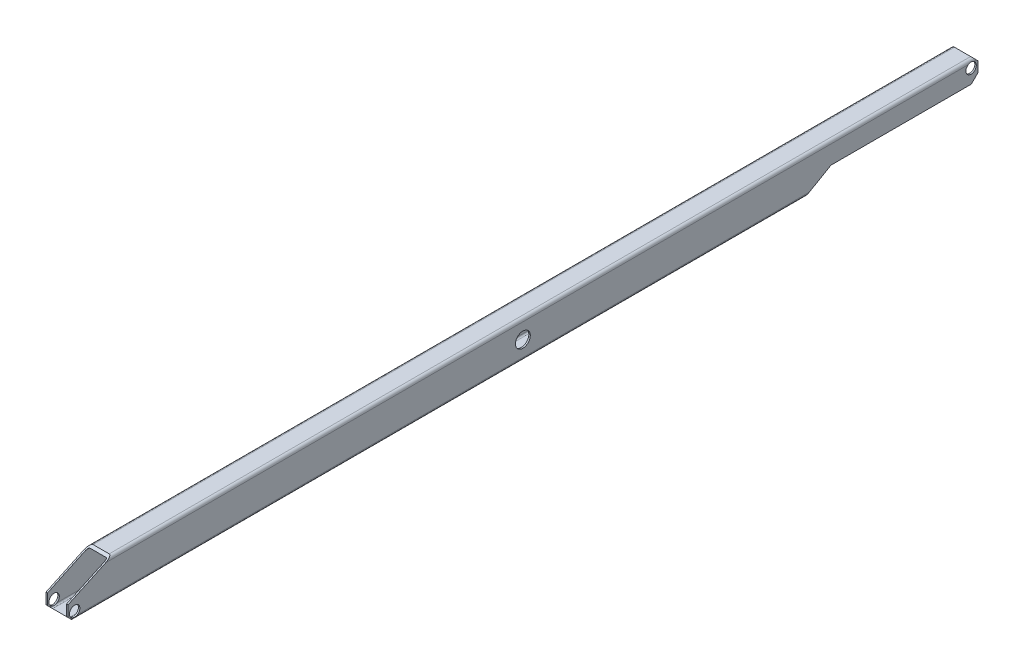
ISO-10303-21;
HEADER;
FILE_DESCRIPTION(('STEP AP214'),'2;1');
FILE_NAME('part.step','',(''),(''),'','','');
FILE_SCHEMA(('AUTOMOTIVE_DESIGN { 1 0 10303 214 1 1 1 1 }'));
ENDSEC;
DATA;
#1=APPLICATION_CONTEXT('core data for automotive mechanical design processes');
#2=APPLICATION_PROTOCOL_DEFINITION('international standard','automotive_design',2000,#1);
#3=PRODUCT_CONTEXT('',#1,'mechanical');
#4=PRODUCT('Part','Part','',(#3));
#5=PRODUCT_RELATED_PRODUCT_CATEGORY('part','',(#4));
#6=PRODUCT_DEFINITION_FORMATION('','',#4);
#7=PRODUCT_DEFINITION_CONTEXT('part definition',#1,'design');
#8=PRODUCT_DEFINITION('design','',#6,#7);
#9=PRODUCT_DEFINITION_SHAPE('','',#8);
#10=(LENGTH_UNIT() NAMED_UNIT(*) SI_UNIT(.MILLI.,.METRE.));
#11=(NAMED_UNIT(*) PLANE_ANGLE_UNIT() SI_UNIT($,.RADIAN.));
#12=(NAMED_UNIT(*) SI_UNIT($,.STERADIAN.) SOLID_ANGLE_UNIT());
#13=UNCERTAINTY_MEASURE_WITH_UNIT(LENGTH_MEASURE(1.E-05),#10,'distance_accuracy_value','');
#14=(GEOMETRIC_REPRESENTATION_CONTEXT(3) GLOBAL_UNCERTAINTY_ASSIGNED_CONTEXT((#13)) GLOBAL_UNIT_ASSIGNED_CONTEXT((#10,
#11,#12)) REPRESENTATION_CONTEXT('',''));
#15=CARTESIAN_POINT('',(0.,0.,0.));
#16=DIRECTION('',(0.,0.,1.));
#17=DIRECTION('',(1.,0.,0.));
#18=AXIS2_PLACEMENT_3D('',#15,#16,#17);
#19=CARTESIAN_POINT('',(20.,20.,3095.));
#20=DIRECTION('',(0.,0.,1.));
#21=DIRECTION('',(1.,0.,0.));
#22=AXIS2_PLACEMENT_3D('',#19,#20,#21);
#23=PLANE('',#22);
#24=DIRECTION('',(0.,1.,0.));
#25=VECTOR('',#24,1.);
#26=CARTESIAN_POINT('',(150.,19.9999999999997,3095.));
#27=LINE('',#26,#25);
#28=CARTESIAN_POINT('',(150.,35.0000000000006,3095.));
#29=VERTEX_POINT('',#28);
#30=CARTESIAN_POINT('',(150.,110.00003901,3095.));
#31=VERTEX_POINT('',#30);
#32=EDGE_CURVE('E308',#29,#31,#27,.T.);
#33=ORIENTED_EDGE('',*,*,#32,.T.);
#34=DIRECTION('',(-1.,0.,0.));
#35=VECTOR('',#34,1.);
#36=CARTESIAN_POINT('',(190.,110.00003901,3095.));
#37=LINE('',#36,#35);
#38=CARTESIAN_POINT('',(140.,110.00003901,3095.));
#39=VERTEX_POINT('',#38);
#40=EDGE_CURVE('E300',#31,#39,#37,.T.);
#41=ORIENTED_EDGE('',*,*,#40,.T.);
#42=DIRECTION('',(0.,1.,0.));
#43=VECTOR('',#42,1.);
#44=CARTESIAN_POINT('',(140.,19.9999999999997,3095.));
#45=LINE('',#44,#43);
#46=CARTESIAN_POINT('',(140.,35.0000000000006,3095.));
#47=VERTEX_POINT('',#46);
#48=EDGE_CURVE('E477',#47,#39,#45,.T.);
#49=ORIENTED_EDGE('',*,*,#48,.F.);
#50=DIRECTION('',(1.,0.,0.));
#51=VECTOR('',#50,1.);
#52=CARTESIAN_POINT('',(130.,35.0000000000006,3095.));
#53=LINE('',#52,#51);
#54=EDGE_CURVE('E378',#47,#29,#53,.T.);
#55=ORIENTED_EDGE('',*,*,#54,.T.);
#56=EDGE_LOOP('',(#33,#41,#49,#55));
#57=FACE_BOUND('',#56,.T.);
#58=ADVANCED_FACE('F50',(#57),#23,.T.);
#59=DIRECTION('',(0.,-1.,0.));
#60=VECTOR('',#59,1.);
#61=CARTESIAN_POINT('',(9.99999999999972,230.00003901,3095.));
#62=LINE('',#61,#60);
#63=CARTESIAN_POINT('',(9.99999999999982,110.00003901,3095.));
#64=VERTEX_POINT('',#63);
#65=CARTESIAN_POINT('',(9.99999999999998,35.0000000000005,3095.));
#66=VERTEX_POINT('',#65);
#67=EDGE_CURVE('E299',#64,#66,#62,.T.);
#68=ORIENTED_EDGE('',*,*,#67,.F.);
#69=CARTESIAN_POINT('',(0.,110.00003901,3095.));
#70=VERTEX_POINT('',#69);
#71=EDGE_CURVE('E284',#64,#70,#37,.T.);
#72=ORIENTED_EDGE('',*,*,#71,.T.);
#73=DIRECTION('',(0.,-1.,0.));
#74=VECTOR('',#73,1.);
#75=CARTESIAN_POINT('',(0.,230.00003901,3095.));
#76=LINE('',#75,#74);
#77=CARTESIAN_POINT('',(0.,35.0000000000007,3095.));
#78=VERTEX_POINT('',#77);
#79=EDGE_CURVE('E297',#70,#78,#76,.T.);
#80=ORIENTED_EDGE('',*,*,#79,.T.);
#81=DIRECTION('',(1.,0.,0.));
#82=VECTOR('',#81,1.);
#83=CARTESIAN_POINT('',(130.,35.0000000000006,3095.));
#84=LINE('',#83,#82);
#85=EDGE_CURVE('E380',#78,#66,#84,.T.);
#86=ORIENTED_EDGE('',*,*,#85,.T.);
#87=EDGE_LOOP('',(#68,#72,#80,#86));
#88=FACE_BOUND('',#87,.T.);
#89=ADVANCED_FACE('F295',(#88),#23,.T.);
#90=CARTESIAN_POINT('',(150.,19.9999999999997,3095.));
#91=DIRECTION('',(-1.,0.,0.));
#92=DIRECTION('',(0.,0.,1.));
#93=AXIS2_PLACEMENT_3D('',#90,#91,#92);
#94=PLANE('',#93);
#95=CARTESIAN_POINT('',(150.000000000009,125.000039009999,1.07772941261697));
#96=DIRECTION('',(1.,0.,0.));
#97=DIRECTION('',(0.,1.,0.));
#98=AXIS2_PLACEMENT_3D('',#95,#96,#97);
#99=CIRCLE('',#98,50.5);
#100=CARTESIAN_POINT('',(150.000000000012,175.500039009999,1.07772941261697));
#101=VERTEX_POINT('',#100);
#102=EDGE_CURVE('E683',#101,#101,#99,.T.);
#103=ORIENTED_EDGE('',*,*,#102,.F.);
#104=EDGE_LOOP('',(#103));
#105=FACE_BOUND('',#104,.T.);
#106=DIRECTION('',(0.,0.422885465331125,-0.906183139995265));
#107=VECTOR('',#106,1.);
#108=CARTESIAN_POINT('',(150.,93.9051415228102,3129.48906604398));
#109=LINE('',#108,#107);
#110=CARTESIAN_POINT('',(150.,230.00003901,2837.85714285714));
#111=VERTEX_POINT('',#110);
#112=EDGE_CURVE('E715',#31,#111,#109,.T.);
#113=ORIENTED_EDGE('',*,*,#112,.F.);
#114=ORIENTED_EDGE('',*,*,#32,.F.);
#115=DIRECTION('',(0.,-0.707106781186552,-0.707106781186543));
#116=VECTOR('',#115,1.);
#117=CARTESIAN_POINT('',(150.,35.0000000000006,3095.));
#118=LINE('',#117,#116);
#119=CARTESIAN_POINT('',(150.,19.9999999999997,3080.));
#120=VERTEX_POINT('',#119);
#121=EDGE_CURVE('E392',#29,#120,#118,.T.);
#122=ORIENTED_EDGE('',*,*,#121,.T.);
#123=DIRECTION('',(0.,0.,-1.));
#124=VECTOR('',#123,1.);
#125=CARTESIAN_POINT('',(150.,19.9999999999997,3095.));
#126=LINE('',#125,#124);
#127=CARTESIAN_POINT('',(150.000000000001,19.9999999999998,3068.9802528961));
#128=VERTEX_POINT('',#127);
#129=EDGE_CURVE('E335',#120,#128,#126,.T.);
#130=ORIENTED_EDGE('',*,*,#129,.T.);
#131=CARTESIAN_POINT('',(150.000000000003,49.9999999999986,3050.));
#132=DIRECTION('',(1.,0.,0.));
#133=DIRECTION('',(0.,1.,0.));
#134=AXIS2_PLACEMENT_3D('',#131,#132,#133);
#135=CIRCLE('',#134,35.4999999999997);
#136=CARTESIAN_POINT('',(150.,19.9999999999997,3031.0197471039));
#137=VERTEX_POINT('',#136);
#138=EDGE_CURVE('E726',#137,#128,#135,.T.);
#139=ORIENTED_EDGE('',*,*,#138,.F.);
#140=CARTESIAN_POINT('',(150.,19.9999999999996,-1947.77561378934));
#141=VERTEX_POINT('',#140);
#142=EDGE_CURVE('E334',#137,#141,#126,.T.);
#143=ORIENTED_EDGE('',*,*,#142,.T.);
#144=DIRECTION('',(0.,0.499999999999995,-0.866025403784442));
#145=VECTOR('',#144,1.);
#146=CARTESIAN_POINT('',(150.,-2163.5858935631,1834.30609655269));
#147=LINE('',#146,#145);
#148=CARTESIAN_POINT('',(150.,105.00003901,-2095.));
#149=VERTEX_POINT('',#148);
#150=EDGE_CURVE('E671',#141,#149,#147,.T.);
#151=ORIENTED_EDGE('',*,*,#150,.T.);
#152=DIRECTION('',(0.,0.,-1.));
#153=VECTOR('',#152,1.);
#154=CARTESIAN_POINT('',(150.,105.00003901,3095.));
#155=LINE('',#154,#153);
#156=CARTESIAN_POINT('',(150.,105.00003901,-3050.00003901));
#157=VERTEX_POINT('',#156);
#158=EDGE_CURVE('E450',#149,#157,#155,.T.);
#159=ORIENTED_EDGE('',*,*,#158,.T.);
#160=DIRECTION('',(0.,-0.707106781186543,0.707106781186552));
#161=VECTOR('',#160,1.);
#162=CARTESIAN_POINT('',(150.,0.,-2945.));
#163=LINE('',#162,#161);
#164=CARTESIAN_POINT('',(150.,150.000000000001,-3095.));
#165=VERTEX_POINT('',#164);
#166=EDGE_CURVE('E406',#157,#165,#163,.F.);
#167=ORIENTED_EDGE('',*,*,#166,.T.);
#168=DIRECTION('',(0.,1.,0.));
#169=VECTOR('',#168,1.);
#170=CARTESIAN_POINT('',(150.,19.9999999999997,-3095.));
#171=LINE('',#170,#169);
#172=CARTESIAN_POINT('',(150.,220.00003901,-3095.));
#173=VERTEX_POINT('',#172);
#174=EDGE_CURVE('E318',#165,#173,#171,.T.);
#175=ORIENTED_EDGE('',*,*,#174,.T.);
#176=DIRECTION('',(0.,-0.707106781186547,-0.707106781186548));
#177=VECTOR('',#176,1.);
#178=CARTESIAN_POINT('',(150.,250.00003901,-3065.));
#179=LINE('',#178,#177);
#180=CARTESIAN_POINT('',(150.,230.00003901,-3085.));
#181=VERTEX_POINT('',#180);
#182=EDGE_CURVE('E372',#173,#181,#179,.F.);
#183=ORIENTED_EDGE('',*,*,#182,.T.);
#184=DIRECTION('',(0.,0.,-1.));
#185=VECTOR('',#184,1.);
#186=CARTESIAN_POINT('',(150.,230.00003901,3095.));
#187=LINE('',#186,#185);
#188=CARTESIAN_POINT('',(150.,230.00003901,-3066.9802528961));
#189=VERTEX_POINT('',#188);
#190=EDGE_CURVE('E331',#189,#181,#187,.T.);
#191=ORIENTED_EDGE('',*,*,#190,.F.);
#192=CARTESIAN_POINT('',(150.000000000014,200.000039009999,-3048.));
#193=DIRECTION('',(1.,0.,0.));
#194=DIRECTION('',(0.,1.,0.));
#195=AXIS2_PLACEMENT_3D('',#192,#193,#194);
#196=CIRCLE('',#195,35.4999999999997);
#197=CARTESIAN_POINT('',(150.000000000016,230.000039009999,-3029.0197471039));
#198=VERTEX_POINT('',#197);
#199=EDGE_CURVE('E690',#198,#189,#196,.T.);
#200=ORIENTED_EDGE('',*,*,#199,.F.);
#201=EDGE_CURVE('E332',#111,#198,#187,.T.);
#202=ORIENTED_EDGE('',*,*,#201,.F.);
#203=EDGE_LOOP('',(#113,#114,#122,#130,#139,#143,#151,#159,#167,#175,#183,#191,#200,#202));
#204=FACE_BOUND('',#203,.T.);
#205=ADVANCED_FACE('F620',(#105,#204),#94,.F.);
#206=CARTESIAN_POINT('',(130.,230.00003901,3095.));
#207=DIRECTION('',(0.,0.,-1.));
#208=DIRECTION('',(-1.,0.,0.));
#209=AXIS2_PLACEMENT_3D('',#206,#207,#208);
#210=CYLINDRICAL_SURFACE('',#209,19.9999999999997);
#211=CARTESIAN_POINT('',(130.,230.00003901,2837.85714285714));
#212=DIRECTION('',(0.,0.906183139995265,0.422885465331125));
#213=DIRECTION('',(0.,0.422885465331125,-0.906183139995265));
#214=AXIS2_PLACEMENT_3D('',#211,#212,#213);
#215=ELLIPSE('',#214,47.2941295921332,19.9999999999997);
#216=CARTESIAN_POINT('',(130.,250.00003901,2795.));
#217=VERTEX_POINT('',#216);
#218=EDGE_CURVE('E708',#111,#217,#215,.T.);
#219=ORIENTED_EDGE('',*,*,#218,.F.);
#220=ORIENTED_EDGE('',*,*,#201,.T.);
#221=CARTESIAN_POINT('',(150.,230.00003901,-3029.0197471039));
#222=CARTESIAN_POINT('',(149.999990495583,230.226028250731,-3029.37693450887));
#223=CARTESIAN_POINT('',(149.99616964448,230.445617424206,-3029.73814262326));
#224=CARTESIAN_POINT('',(149.982135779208,230.871690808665,-3030.46804116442));
#225=CARTESIAN_POINT('',(149.971923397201,231.078176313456,-3030.83673084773));
#226=CARTESIAN_POINT('',(149.946342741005,231.477685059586,-3031.58092305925));
#227=CARTESIAN_POINT('',(149.930976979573,231.670714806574,-3031.95642218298));
#228=CARTESIAN_POINT('',(149.896243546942,232.043189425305,-3032.71390578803));
#229=CARTESIAN_POINT('',(149.876875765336,232.222633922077,-3033.095890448));
#230=CARTESIAN_POINT('',(149.814376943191,232.740812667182,-3034.25206565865));
#231=CARTESIAN_POINT('',(149.766893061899,233.058824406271,-3035.03541956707));
#232=CARTESIAN_POINT('',(149.668517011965,233.638150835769,-3036.62276659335));
#233=CARTESIAN_POINT('',(149.617624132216,233.899453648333,-3037.42676399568));
#234=CARTESIAN_POINT('',(149.540295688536,234.265649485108,-3038.70725225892));
#235=CARTESIAN_POINT('',(149.512632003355,234.389910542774,-3039.17820928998));
#236=CARTESIAN_POINT('',(149.45968343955,234.618975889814,-3040.1249538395));
#237=CARTESIAN_POINT('',(149.434398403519,234.723781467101,-3040.60074103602));
#238=CARTESIAN_POINT('',(149.387236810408,234.913756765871,-3041.55642200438));
#239=CARTESIAN_POINT('',(149.365360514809,234.998924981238,-3042.03631608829));
#240=CARTESIAN_POINT('',(149.325878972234,235.149452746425,-3042.99937599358));
#241=CARTESIAN_POINT('',(149.308273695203,235.214812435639,-3043.48254179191));
#242=CARTESIAN_POINT('',(149.278025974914,235.325544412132,-3044.45091848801));
#243=CARTESIAN_POINT('',(149.265379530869,235.370932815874,-3044.93612741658));
#244=CARTESIAN_POINT('',(149.245510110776,235.441701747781,-3045.90811504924));
#245=CARTESIAN_POINT('',(149.238287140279,235.467082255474,-3046.39489375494));
#246=CARTESIAN_POINT('',(149.229537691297,235.497778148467,-3047.36911402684));
#247=CARTESIAN_POINT('',(149.228010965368,235.503094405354,-3047.85655556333));
#248=CARTESIAN_POINT('',(149.230710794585,235.493652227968,-3048.83122769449));
#249=CARTESIAN_POINT('',(149.234937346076,235.478893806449,-3049.31845828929));
#250=CARTESIAN_POINT('',(149.24898690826,235.42932676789,-3050.29198760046));
#251=CARTESIAN_POINT('',(149.258811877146,235.394511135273,-3050.77828593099));
#252=CARTESIAN_POINT('',(149.283687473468,235.304900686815,-3051.74890335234));
#253=CARTESIAN_POINT('',(149.298738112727,235.250105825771,-3052.23322243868));
#254=CARTESIAN_POINT('',(149.333491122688,235.120645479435,-3053.19908064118));
#255=CARTESIAN_POINT('',(149.353193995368,235.045977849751,-3053.68061945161));
#256=CARTESIAN_POINT('',(149.396484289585,234.876924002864,-3054.64004235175));
#257=CARTESIAN_POINT('',(149.420071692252,234.782537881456,-3055.11792645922));
#258=CARTESIAN_POINT('',(149.470193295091,234.574210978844,-3056.06931193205));
#259=CARTESIAN_POINT('',(149.496727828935,234.460267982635,-3056.54281279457));
#260=CARTESIAN_POINT('',(149.551645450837,234.213018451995,-3057.48467860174));
#261=CARTESIAN_POINT('',(149.580028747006,234.079709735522,-3057.95304296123));
#262=CARTESIAN_POINT('',(149.637389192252,233.794003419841,-3058.88369511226));
#263=CARTESIAN_POINT('',(149.666366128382,233.64161256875,-3059.34598498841));
#264=CARTESIAN_POINT('',(149.723553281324,233.317937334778,-3060.26395201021));
#265=CARTESIAN_POINT('',(149.751763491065,233.146652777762,-3060.71962909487));
#266=CARTESIAN_POINT('',(149.809140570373,232.764037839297,-3061.67723564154));
#267=CARTESIAN_POINT('',(149.838024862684,232.550367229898,-3062.17824936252));
#268=CARTESIAN_POINT('',(149.890722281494,232.100157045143,-3063.17000099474));
#269=CARTESIAN_POINT('',(149.914536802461,231.863623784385,-3063.66074169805));
#270=CARTESIAN_POINT('',(149.95466410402,231.368608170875,-3064.6300419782));
#271=CARTESIAN_POINT('',(149.970992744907,231.110173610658,-3065.10862526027));
#272=CARTESIAN_POINT('',(149.993649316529,230.571387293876,-3066.05377894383));
#273=CARTESIAN_POINT('',(149.999973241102,230.291026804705,-3066.52034445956));
#274=CARTESIAN_POINT('',(150.,230.00003901,-3066.9802528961));
#275=B_SPLINE_CURVE_WITH_KNOTS('',3,(#221,#222,#223,#224,#225,#226,#227,#228,#229,#230,#231,
#232,#233,#234,#235,#236,#237,#238,#239,#240,#241,#242,#243,#244,#245,#246,#247,#248,#249,#250,
#251,#252,#253,#254,#255,#256,#257,#258,#259,#260,#261,#262,#263,#264,#265,#266,#267,#268,#269,
#270,#271,#272,#273,#274),.UNSPECIFIED.,.F.,.F.,(4,2,2,2,2,2,2,2,2,2,2,2,2,2,2,2,2,2,2,2,2,2,2,
2,2,2,4),(0.,1.26790395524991,2.53568252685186,3.80284383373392,5.07004010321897,
7.60802803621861,10.1465470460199,11.6097583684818,13.0728727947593,14.5360993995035,
15.9993157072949,17.4613490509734,18.9233838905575,20.3853552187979,21.8473256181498,
23.3098076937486,24.772293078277,26.2349363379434,27.6975724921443,29.1603744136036,
30.6233412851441,32.0857922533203,33.5482567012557,35.1839738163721,36.8192404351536,
38.4510262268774,40.0834652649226),.UNSPECIFIED.);
#276=EDGE_CURVE('E600',#198,#189,#275,.T.);
#277=ORIENTED_EDGE('',*,*,#276,.T.);
#278=ORIENTED_EDGE('',*,*,#190,.T.);
#279=CARTESIAN_POINT('',(130.,230.00003901,-3085.));
#280=DIRECTION('',(0.,-0.707106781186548,0.707106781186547));
#281=DIRECTION('',(0.,-0.707106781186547,-0.707106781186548));
#282=AXIS2_PLACEMENT_3D('',#279,#280,#281);
#283=ELLIPSE('',#282,28.2842712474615,19.9999999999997);
#284=CARTESIAN_POINT('',(130.,250.00003901,-3065.));
#285=VERTEX_POINT('',#284);
#286=EDGE_CURVE('E375',#181,#285,#283,.T.);
#287=ORIENTED_EDGE('',*,*,#286,.T.);
#288=DIRECTION('',(0.,0.,-1.));
#289=VECTOR('',#288,1.);
#290=CARTESIAN_POINT('',(130.,250.00003901,3095.));
#291=LINE('',#290,#289);
#292=EDGE_CURVE('E329',#217,#285,#291,.T.);
#293=ORIENTED_EDGE('',*,*,#292,.F.);
#294=EDGE_LOOP('',(#219,#220,#277,#278,#287,#293));
#295=FACE_BOUND('',#294,.T.);
#296=ADVANCED_FACE('F615',(#295),#210,.T.);
#297=CARTESIAN_POINT('',(130.,250.00003901,3095.));
#298=DIRECTION('',(0.,-1.,0.));
#299=DIRECTION('',(1.,0.,0.));
#300=AXIS2_PLACEMENT_3D('',#297,#298,#299);
#301=PLANE('',#300);
#302=DIRECTION('',(-1.,0.,0.));
#303=VECTOR('',#302,1.);
#304=CARTESIAN_POINT('',(190.,250.00003901,2795.));
#305=LINE('',#304,#303);
#306=CARTESIAN_POINT('',(19.9999999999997,250.00003901,2795.));
#307=VERTEX_POINT('',#306);
#308=EDGE_CURVE('E291',#217,#307,#305,.T.);
#309=ORIENTED_EDGE('',*,*,#308,.F.);
#310=ORIENTED_EDGE('',*,*,#292,.T.);
#311=DIRECTION('',(-1.,0.,0.));
#312=VECTOR('',#311,1.);
#313=CARTESIAN_POINT('',(130.,250.00003901,-3065.));
#314=LINE('',#313,#312);
#315=CARTESIAN_POINT('',(19.9999999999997,250.00003901,-3065.));
#316=VERTEX_POINT('',#315);
#317=EDGE_CURVE('E344',#285,#316,#314,.T.);
#318=ORIENTED_EDGE('',*,*,#317,.T.);
#319=DIRECTION('',(0.,0.,-1.));
#320=VECTOR('',#319,1.);
#321=CARTESIAN_POINT('',(19.9999999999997,250.00003901,3095.));
#322=LINE('',#321,#320);
#323=EDGE_CURVE('E327',#307,#316,#322,.T.);
#324=ORIENTED_EDGE('',*,*,#323,.F.);
#325=EDGE_LOOP('',(#309,#310,#318,#324));
#326=FACE_BOUND('',#325,.T.);
#327=ADVANCED_FACE('F611',(#326),#301,.F.);
#328=CARTESIAN_POINT('',(19.9999999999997,230.00003901,3095.));
#329=DIRECTION('',(0.,0.,-1.));
#330=DIRECTION('',(-1.,0.,0.));
#331=AXIS2_PLACEMENT_3D('',#328,#329,#330);
#332=CYLINDRICAL_SURFACE('',#331,19.9999999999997);
#333=CARTESIAN_POINT('',(19.9999999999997,230.00003901,2837.85714285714));
#334=DIRECTION('',(0.,0.906183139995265,0.422885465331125));
#335=DIRECTION('',(0.,0.422885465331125,-0.906183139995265));
#336=AXIS2_PLACEMENT_3D('',#333,#334,#335);
#337=ELLIPSE('',#336,47.2941295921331,19.9999999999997);
#338=CARTESIAN_POINT('',(0.,230.000039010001,2837.85714285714));
#339=VERTEX_POINT('',#338);
#340=EDGE_CURVE('E287',#307,#339,#337,.T.);
#341=ORIENTED_EDGE('',*,*,#340,.F.);
#342=ORIENTED_EDGE('',*,*,#323,.T.);
#343=CARTESIAN_POINT('',(19.9999999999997,230.00003901,-3085.));
#344=DIRECTION('',(0.,-0.707106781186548,0.707106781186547));
#345=DIRECTION('',(0.,-0.707106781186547,-0.707106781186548));
#346=AXIS2_PLACEMENT_3D('',#343,#344,#345);
#347=ELLIPSE('',#346,28.2842712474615,19.9999999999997);
#348=CARTESIAN_POINT('',(0.,230.000039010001,-3085.));
#349=VERTEX_POINT('',#348);
#350=EDGE_CURVE('E347',#316,#349,#347,.T.);
#351=ORIENTED_EDGE('',*,*,#350,.T.);
#352=DIRECTION('',(0.,0.,-1.));
#353=VECTOR('',#352,1.);
#354=CARTESIAN_POINT('',(0.,230.00003901,3095.));
#355=LINE('',#354,#353);
#356=CARTESIAN_POINT('',(0.,230.00003901,-3066.98025289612));
#357=VERTEX_POINT('',#356);
#358=EDGE_CURVE('E324',#357,#349,#355,.T.);
#359=ORIENTED_EDGE('',*,*,#358,.F.);
#360=CARTESIAN_POINT('',(0.,230.00003901,-3066.98025289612));
#361=CARTESIAN_POINT('',(9.50441717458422E-06,230.226028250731,-3066.62306549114));
#362=CARTESIAN_POINT('',(0.00383035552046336,230.445617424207,-3066.26185737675));
#363=CARTESIAN_POINT('',(0.0178642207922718,230.871690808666,-3065.53195883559));
#364=CARTESIAN_POINT('',(0.028076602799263,231.078176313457,-3065.16326915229));
#365=CARTESIAN_POINT('',(0.0536572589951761,231.477685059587,-3064.41907694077));
#366=CARTESIAN_POINT('',(0.0690230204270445,231.670714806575,-3064.04357781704));
#367=CARTESIAN_POINT('',(0.103756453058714,232.043189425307,-3063.28609421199));
#368=CARTESIAN_POINT('',(0.123124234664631,232.222633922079,-3062.90410955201));
#369=CARTESIAN_POINT('',(0.185623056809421,232.740812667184,-3061.74793434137));
#370=CARTESIAN_POINT('',(0.233106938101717,233.058824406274,-3060.96458043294));
#371=CARTESIAN_POINT('',(0.331482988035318,233.638150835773,-3059.37723340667));
#372=CARTESIAN_POINT('',(0.382375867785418,233.899453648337,-3058.57323600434));
#373=CARTESIAN_POINT('',(0.459704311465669,234.265649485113,-3057.2927477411));
#374=CARTESIAN_POINT('',(0.48736799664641,234.38991054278,-3056.82179071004));
#375=CARTESIAN_POINT('',(0.540316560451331,234.61897588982,-3055.87504616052));
#376=CARTESIAN_POINT('',(0.565601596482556,234.723781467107,-3055.399258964));
#377=CARTESIAN_POINT('',(0.612763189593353,234.913756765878,-3054.44357799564));
#378=CARTESIAN_POINT('',(0.634639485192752,234.998924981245,-3053.96368391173));
#379=CARTESIAN_POINT('',(0.674121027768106,235.149452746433,-3053.00062400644));
#380=CARTESIAN_POINT('',(0.691726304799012,235.214812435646,-3052.51745820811));
#381=CARTESIAN_POINT('',(0.721974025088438,235.32554441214,-3051.54908151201));
#382=CARTESIAN_POINT('',(0.734620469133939,235.370932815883,-3051.06387258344));
#383=CARTESIAN_POINT('',(0.754489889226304,235.44170174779,-3050.09188495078));
#384=CARTESIAN_POINT('',(0.761712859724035,235.467082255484,-3049.60510624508));
#385=CARTESIAN_POINT('',(0.770462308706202,235.497778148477,-3048.63088597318));
#386=CARTESIAN_POINT('',(0.771989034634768,235.503094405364,-3048.14344443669));
#387=CARTESIAN_POINT('',(0.769289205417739,235.493652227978,-3047.16877230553));
#388=CARTESIAN_POINT('',(0.765062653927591,235.47889380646,-3046.68154171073));
#389=CARTESIAN_POINT('',(0.751013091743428,235.429326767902,-3045.70801239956));
#390=CARTESIAN_POINT('',(0.741188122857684,235.394511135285,-3045.22171406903));
#391=CARTESIAN_POINT('',(0.716312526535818,235.304900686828,-3044.25109664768));
#392=CARTESIAN_POINT('',(0.701261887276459,235.250105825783,-3043.76677756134));
#393=CARTESIAN_POINT('',(0.666508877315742,235.120645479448,-3042.80091935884));
#394=CARTESIAN_POINT('',(0.646806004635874,235.045977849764,-3042.31938054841));
#395=CARTESIAN_POINT('',(0.603515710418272,234.876924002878,-3041.35995764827));
#396=CARTESIAN_POINT('',(0.579928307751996,234.78253788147,-3040.8820735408));
#397=CARTESIAN_POINT('',(0.529806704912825,234.574210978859,-3039.93068806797));
#398=CARTESIAN_POINT('',(0.503272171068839,234.46026798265,-3039.45718720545));
#399=CARTESIAN_POINT('',(0.448354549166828,234.213018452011,-3038.51532139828));
#400=CARTESIAN_POINT('',(0.419971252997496,234.079709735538,-3038.04695703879));
#401=CARTESIAN_POINT('',(0.362610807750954,233.794003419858,-3037.11630488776));
#402=CARTESIAN_POINT('',(0.333633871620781,233.641612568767,-3036.65401501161));
#403=CARTESIAN_POINT('',(0.276446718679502,233.317937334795,-3035.73604798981));
#404=CARTESIAN_POINT('',(0.248236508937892,233.14665277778,-3035.28037090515));
#405=CARTESIAN_POINT('',(0.190859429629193,232.764037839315,-3034.32276435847));
#406=CARTESIAN_POINT('',(0.161975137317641,232.550367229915,-3033.82175063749));
#407=CARTESIAN_POINT('',(0.109277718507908,232.100157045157,-3032.82999900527));
#408=CARTESIAN_POINT('',(0.0854631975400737,231.863623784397,-3032.33925830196));
#409=CARTESIAN_POINT('',(0.0453358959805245,231.368608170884,-3031.3699580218));
#410=CARTESIAN_POINT('',(0.0290072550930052,231.110173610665,-3030.89137473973));
#411=CARTESIAN_POINT('',(0.00635068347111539,230.57138729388,-3029.94622105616));
#412=CARTESIAN_POINT('',(2.67588981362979E-05,230.291026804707,-3029.47965554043));
#413=CARTESIAN_POINT('',(0.,230.00003901,-3029.01974710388));
#414=B_SPLINE_CURVE_WITH_KNOTS('',3,(#360,#361,#362,#363,#364,#365,#366,#367,#368,#369,#370,
#371,#372,#373,#374,#375,#376,#377,#378,#379,#380,#381,#382,#383,#384,#385,#386,#387,#388,#389,
#390,#391,#392,#393,#394,#395,#396,#397,#398,#399,#400,#401,#402,#403,#404,#405,#406,#407,#408,
#409,#410,#411,#412,#413),.UNSPECIFIED.,.F.,.F.,(4,2,2,2,2,2,2,2,2,2,2,2,2,2,2,2,2,2,2,2,2,2,2,
2,2,2,4),(0.,1.26790395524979,2.53568252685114,3.80284383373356,5.07004010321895,
7.60802803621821,10.14654704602,11.6097583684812,13.0728727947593,14.5360993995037,
15.9993157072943,17.4613490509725,18.9233838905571,20.385355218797,21.847325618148,
23.3098076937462,24.7722930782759,26.2349363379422,27.6975724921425,29.1603744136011,
30.6233412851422,32.0857922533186,33.5482567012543,35.183973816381,36.8192404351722,
38.4510262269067,40.0834652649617),.UNSPECIFIED.);
#415=CARTESIAN_POINT('',(0.,230.00003901,-3029.01974710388));
#416=VERTEX_POINT('',#415);
#417=EDGE_CURVE('E591',#357,#416,#414,.T.);
#418=ORIENTED_EDGE('',*,*,#417,.T.);
#419=EDGE_CURVE('E325',#339,#416,#355,.T.);
#420=ORIENTED_EDGE('',*,*,#419,.F.);
#421=EDGE_LOOP('',(#341,#342,#351,#359,#418,#420));
#422=FACE_BOUND('',#421,.T.);
#423=ADVANCED_FACE('F606',(#422),#332,.T.);
#424=CARTESIAN_POINT('',(0.,230.00003901,3095.));
#425=DIRECTION('',(1.,0.,0.));
#426=DIRECTION('',(0.,1.,0.));
#427=AXIS2_PLACEMENT_3D('',#424,#425,#426);
#428=PLANE('',#427);
#429=CARTESIAN_POINT('',(0.,125.000039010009,1.07772941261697));
#430=DIRECTION('',(1.,0.,0.));
#431=DIRECTION('',(0.,1.,0.));
#432=AXIS2_PLACEMENT_3D('',#429,#430,#431);
#433=CIRCLE('',#432,50.5);
#434=CARTESIAN_POINT('',(0.,175.500039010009,1.07772941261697));
#435=VERTEX_POINT('',#434);
#436=EDGE_CURVE('E411',#435,#435,#433,.F.);
#437=ORIENTED_EDGE('',*,*,#436,.F.);
#438=EDGE_LOOP('',(#437));
#439=FACE_BOUND('',#438,.T.);
#440=DIRECTION('',(0.,0.422885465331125,-0.906183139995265));
#441=VECTOR('',#440,1.);
#442=CARTESIAN_POINT('',(0.,414.57115175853,2442.34761553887));
#443=LINE('',#442,#441);
#444=EDGE_CURVE('E281',#70,#339,#443,.T.);
#445=ORIENTED_EDGE('',*,*,#444,.T.);
#446=ORIENTED_EDGE('',*,*,#419,.T.);
#447=CARTESIAN_POINT('',(0.,200.000039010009,-3048.));
#448=DIRECTION('',(1.,0.,0.));
#449=DIRECTION('',(0.,1.,0.));
#450=AXIS2_PLACEMENT_3D('',#447,#448,#449);
#451=CIRCLE('',#450,35.4999999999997);
#452=EDGE_CURVE('E692',#357,#416,#451,.F.);
#453=ORIENTED_EDGE('',*,*,#452,.F.);
#454=ORIENTED_EDGE('',*,*,#358,.T.);
#455=DIRECTION('',(0.,0.707106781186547,0.707106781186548));
#456=VECTOR('',#455,1.);
#457=CARTESIAN_POINT('',(0.,250.00003901,-3065.));
#458=LINE('',#457,#456);
#459=CARTESIAN_POINT('',(0.,220.00003901,-3095.));
#460=VERTEX_POINT('',#459);
#461=EDGE_CURVE('E350',#349,#460,#458,.F.);
#462=ORIENTED_EDGE('',*,*,#461,.T.);
#463=DIRECTION('',(0.,-1.,0.));
#464=VECTOR('',#463,1.);
#465=CARTESIAN_POINT('',(0.,230.00003901,-3095.));
#466=LINE('',#465,#464);
#467=CARTESIAN_POINT('',(0.,150.000000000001,-3095.));
#468=VERTEX_POINT('',#467);
#469=EDGE_CURVE('E314',#460,#468,#466,.T.);
#470=ORIENTED_EDGE('',*,*,#469,.T.);
#471=DIRECTION('',(0.,0.707106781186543,-0.707106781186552));
#472=VECTOR('',#471,1.);
#473=CARTESIAN_POINT('',(0.,0.,-2945.));
#474=LINE('',#473,#472);
#475=CARTESIAN_POINT('',(0.,105.00003901,-3050.00003901));
#476=VERTEX_POINT('',#475);
#477=EDGE_CURVE('E422',#468,#476,#474,.F.);
#478=ORIENTED_EDGE('',*,*,#477,.T.);
#479=DIRECTION('',(0.,0.,-1.));
#480=VECTOR('',#479,1.);
#481=CARTESIAN_POINT('',(0.,105.00003901,-3184.75477056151));
#482=LINE('',#481,#480);
#483=CARTESIAN_POINT('',(0.,105.00003901,-2095.));
#484=VERTEX_POINT('',#483);
#485=EDGE_CURVE('E437',#484,#476,#482,.T.);
#486=ORIENTED_EDGE('',*,*,#485,.F.);
#487=DIRECTION('',(0.,0.499999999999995,-0.866025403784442));
#488=VECTOR('',#487,1.);
#489=CARTESIAN_POINT('',(0.,105.00003901,-2095.));
#490=LINE('',#489,#488);
#491=CARTESIAN_POINT('',(0.,20.0000000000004,-1947.77561378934));
#492=VERTEX_POINT('',#491);
#493=EDGE_CURVE('E717',#492,#484,#490,.T.);
#494=ORIENTED_EDGE('',*,*,#493,.F.);
#495=DIRECTION('',(0.,0.,-1.));
#496=VECTOR('',#495,1.);
#497=CARTESIAN_POINT('',(0.,20.,3095.));
#498=LINE('',#497,#496);
#499=CARTESIAN_POINT('',(0.,20.0000000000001,3031.01974710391));
#500=VERTEX_POINT('',#499);
#501=EDGE_CURVE('E307',#500,#492,#498,.T.);
#502=ORIENTED_EDGE('',*,*,#501,.F.);
#503=CARTESIAN_POINT('',(0.,50.000000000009,3050.));
#504=DIRECTION('',(1.,0.,0.));
#505=DIRECTION('',(0.,1.,0.));
#506=AXIS2_PLACEMENT_3D('',#503,#504,#505);
#507=CIRCLE('',#506,35.4999999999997);
#508=CARTESIAN_POINT('',(0.,20.,3068.98025289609));
#509=VERTEX_POINT('',#508);
#510=EDGE_CURVE('E725',#509,#500,#507,.F.);
#511=ORIENTED_EDGE('',*,*,#510,.F.);
#512=CARTESIAN_POINT('',(0.,20.,3080.));
#513=VERTEX_POINT('',#512);
#514=EDGE_CURVE('E311',#513,#509,#498,.T.);
#515=ORIENTED_EDGE('',*,*,#514,.F.);
#516=DIRECTION('',(0.,0.707106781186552,0.707106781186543));
#517=VECTOR('',#516,1.);
#518=CARTESIAN_POINT('',(0.,35.0000000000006,3095.));
#519=LINE('',#518,#517);
#520=EDGE_CURVE('E305',#513,#78,#519,.T.);
#521=ORIENTED_EDGE('',*,*,#520,.T.);
#522=ORIENTED_EDGE('',*,*,#79,.F.);
#523=EDGE_LOOP('',(#445,#446,#453,#454,#462,#470,#478,#486,#494,#502,#511,#515,#521,#522));
#524=FACE_BOUND('',#523,.T.);
#525=ADVANCED_FACE('F302',(#439,#524),#428,.F.);
#526=CARTESIAN_POINT('',(130.,230.00003901,3095.));
#527=DIRECTION('',(0.,0.,-1.));
#528=DIRECTION('',(-1.,0.,0.));
#529=AXIS2_PLACEMENT_3D('',#526,#527,#528);
#530=CYLINDRICAL_SURFACE('',#529,9.99999999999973);
#531=DIRECTION('',(0.,0.,-1.));
#532=VECTOR('',#531,1.);
#533=CARTESIAN_POINT('',(140.,230.00003901,3095.));
#534=LINE('',#533,#532);
#535=CARTESIAN_POINT('',(140.,230.00003901,2837.85714285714));
#536=VERTEX_POINT('',#535);
#537=CARTESIAN_POINT('',(140.,230.00003901,-3029.0197471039));
#538=VERTEX_POINT('',#537);
#539=EDGE_CURVE('E480',#536,#538,#534,.T.);
#540=ORIENTED_EDGE('',*,*,#539,.F.);
#541=CARTESIAN_POINT('',(130.,230.00003901,2837.85714285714));
#542=DIRECTION('',(0.,0.906183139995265,0.422885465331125));
#543=DIRECTION('',(0.,0.422885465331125,-0.906183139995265));
#544=AXIS2_PLACEMENT_3D('',#541,#542,#543);
#545=ELLIPSE('',#544,23.6470647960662,9.99999999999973);
#546=CARTESIAN_POINT('',(130.,240.00003901,2816.42857142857));
#547=VERTEX_POINT('',#546);
#548=EDGE_CURVE('E65',#536,#547,#545,.T.);
#549=ORIENTED_EDGE('',*,*,#548,.T.);
#550=DIRECTION('',(0.,0.,-1.));
#551=VECTOR('',#550,1.);
#552=CARTESIAN_POINT('',(130.,240.00003901,3095.));
#553=LINE('',#552,#551);
#554=CARTESIAN_POINT('',(130.,240.00003901,-3075.));
#555=VERTEX_POINT('',#554);
#556=EDGE_CURVE('E320',#547,#555,#553,.T.);
#557=ORIENTED_EDGE('',*,*,#556,.T.);
#558=CARTESIAN_POINT('',(130.,230.00003901,-3085.));
#559=DIRECTION('',(0.,-0.707106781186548,0.707106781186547));
#560=DIRECTION('',(0.,-0.707106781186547,-0.707106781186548));
#561=AXIS2_PLACEMENT_3D('',#558,#559,#560);
#562=ELLIPSE('',#561,14.1421356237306,9.99999999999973);
#563=CARTESIAN_POINT('',(140.,230.00003901,-3085.));
#564=VERTEX_POINT('',#563);
#565=EDGE_CURVE('E366',#555,#564,#562,.F.);
#566=ORIENTED_EDGE('',*,*,#565,.T.);
#567=CARTESIAN_POINT('',(140.,230.00003901,-3066.9802528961));
#568=VERTEX_POINT('',#567);
#569=EDGE_CURVE('E483',#568,#564,#534,.T.);
#570=ORIENTED_EDGE('',*,*,#569,.F.);
#571=CARTESIAN_POINT('',(140.,230.00003901,-3029.0197471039));
#572=CARTESIAN_POINT('',(139.999972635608,230.217310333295,-3029.36314780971));
#573=CARTESIAN_POINT('',(139.992920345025,230.4286314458,-3029.71022555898));
#574=CARTESIAN_POINT('',(139.966872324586,230.838994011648,-3030.41098361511));
#575=CARTESIAN_POINT('',(139.947880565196,231.038039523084,-3030.76466168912));
#576=CARTESIAN_POINT('',(139.900093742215,231.423321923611,-3031.47755294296));
#577=CARTESIAN_POINT('',(139.871313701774,231.609577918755,-3031.83675683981));
#578=CARTESIAN_POINT('',(139.805859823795,231.969444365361,-3032.56074569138));
#579=CARTESIAN_POINT('',(139.769185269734,232.143053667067,-3032.9255311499));
#580=CARTESIAN_POINT('',(139.64965839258,232.646467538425,-3034.03149634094));
#581=CARTESIAN_POINT('',(139.557586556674,232.956872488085,-3034.78060915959));
#582=CARTESIAN_POINT('',(139.362788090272,233.525444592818,-3036.2972743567));
#583=CARTESIAN_POINT('',(139.260056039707,233.783584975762,-3037.06483596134));
#584=CARTESIAN_POINT('',(139.045920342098,234.272050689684,-3038.70032558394));
#585=CARTESIAN_POINT('',(138.934783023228,234.49633268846,-3039.57011807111));
#586=CARTESIAN_POINT('',(138.782618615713,234.783053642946,-3040.88706667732));
#587=CARTESIAN_POINT('',(138.734319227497,234.870345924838,-3041.32810936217));
#588=CARTESIAN_POINT('',(138.644403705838,235.028216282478,-3042.21388484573));
#589=CARTESIAN_POINT('',(138.602787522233,235.098794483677,-3042.6586176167));
#590=CARTESIAN_POINT('',(138.52807963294,235.222784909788,-3043.54921978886));
#591=CARTESIAN_POINT('',(138.494952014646,235.276269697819,-3043.99507606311));
#592=CARTESIAN_POINT('',(138.438353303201,235.366325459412,-3044.88911249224));
#593=CARTESIAN_POINT('',(138.414882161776,235.402896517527,-3045.33729263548));
#594=CARTESIAN_POINT('',(138.378600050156,235.458993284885,-3046.23510858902));
#595=CARTESIAN_POINT('',(138.365787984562,235.478520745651,-3046.68474424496));
#596=CARTESIAN_POINT('',(138.351378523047,235.500461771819,-3047.58461531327));
#597=CARTESIAN_POINT('',(138.349781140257,235.502875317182,-3048.03485072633));
#598=CARTESIAN_POINT('',(138.357937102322,235.490480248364,-3048.94218309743));
#599=CARTESIAN_POINT('',(138.367872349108,235.475395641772,-3049.39927465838));
#600=CARTESIAN_POINT('',(138.398944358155,235.427611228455,-3050.31215100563));
#601=CARTESIAN_POINT('',(138.420081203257,235.394911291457,-3050.76793578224));
#602=CARTESIAN_POINT('',(138.472624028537,235.312010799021,-3051.67738822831));
#603=CARTESIAN_POINT('',(138.504031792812,235.26180720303,-3052.13105551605));
#604=CARTESIAN_POINT('',(138.575764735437,235.144064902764,-3053.03541376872));
#605=CARTESIAN_POINT('',(138.61608993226,235.076526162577,-3053.48610472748));
#606=CARTESIAN_POINT('',(138.704164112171,234.923991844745,-3054.38564344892));
#607=CARTESIAN_POINT('',(138.751941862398,234.838928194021,-3054.83447684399));
#608=CARTESIAN_POINT('',(138.852876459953,234.65169100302,-3055.72796412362));
#609=CARTESIAN_POINT('',(138.906033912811,234.549515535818,-3056.17261753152));
#610=CARTESIAN_POINT('',(139.070470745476,234.217583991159,-3057.49951748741));
#611=CARTESIAN_POINT('',(139.186740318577,233.962381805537,-3058.37494484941));
#612=CARTESIAN_POINT('',(139.390085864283,233.447558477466,-3059.91740734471));
#613=CARTESIAN_POINT('',(139.478050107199,233.200759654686,-3060.58866878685));
#614=CARTESIAN_POINT('',(139.641975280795,232.666568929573,-3061.91614782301));
#615=CARTESIAN_POINT('',(139.71794209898,232.379197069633,-3062.57237265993));
#616=CARTESIAN_POINT('',(139.815432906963,231.918814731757,-3063.54249530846));
#617=CARTESIAN_POINT('',(139.845137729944,231.760857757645,-3063.86278991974));
#618=CARTESIAN_POINT('',(139.897867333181,231.435116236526,-3064.49889625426));
#619=CARTESIAN_POINT('',(139.920892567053,231.267332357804,-3064.81470828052));
#620=CARTESIAN_POINT('',(139.958942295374,230.921847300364,-3065.44190622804));
#621=CARTESIAN_POINT('',(139.973956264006,230.744133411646,-3065.75328580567));
#622=CARTESIAN_POINT('',(139.994477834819,230.379171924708,-3066.3708208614));
#623=CARTESIAN_POINT('',(139.999983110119,230.191922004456,-3066.67697504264));
#624=CARTESIAN_POINT('',(140.,230.00003901,-3066.9802528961));
#625=B_SPLINE_CURVE_WITH_KNOTS('',3,(#571,#572,#573,#574,#575,#576,#577,#578,#579,#580,#581,
#582,#583,#584,#585,#586,#587,#588,#589,#590,#591,#592,#593,#594,#595,#596,#597,#598,#599,#600,
#601,#602,#603,#604,#605,#606,#607,#608,#609,#610,#611,#612,#613,#614,#615,#616,#617,#618,#619,
#620,#621,#622,#623,#624),.UNSPECIFIED.,.F.,.F.,(4,2,2,2,2,2,2,2,2,2,2,2,2,2,2,2,2,2,2,2,2,2,2,
2,2,2,4),(0.,1.21886100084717,2.43731688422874,3.6539110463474,4.87061567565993,7.3165546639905,
9.76374341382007,12.4760580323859,13.8323154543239,15.188562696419,16.5389736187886,
17.8893777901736,19.2396431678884,20.5899101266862,21.961767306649,23.3336346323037,
24.7057403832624,26.0778489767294,27.4553913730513,28.8330889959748,31.5877485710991,
33.7483366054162,35.9078610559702,36.9827581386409,38.0575822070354,39.1338150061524,
40.2103111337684),.UNSPECIFIED.);
#626=EDGE_CURVE('E694',#538,#568,#625,.T.);
#627=ORIENTED_EDGE('',*,*,#626,.F.);
#628=EDGE_LOOP('',(#540,#549,#557,#566,#570,#627));
#629=FACE_BOUND('',#628,.T.);
#630=ADVANCED_FACE('F504',(#629),#530,.F.);
#631=CARTESIAN_POINT('',(130.,240.00003901,3095.));
#632=DIRECTION('',(0.,-1.,0.));
#633=DIRECTION('',(0.,0.,-1.));
#634=AXIS2_PLACEMENT_3D('',#631,#632,#633);
#635=PLANE('',#634);
#636=ORIENTED_EDGE('',*,*,#556,.F.);
#637=DIRECTION('',(-1.,0.,0.));
#638=VECTOR('',#637,1.);
#639=CARTESIAN_POINT('',(130.,240.00003901,2816.42857142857));
#640=LINE('',#639,#638);
#641=CARTESIAN_POINT('',(19.9999999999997,240.00003901,2816.42857142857));
#642=VERTEX_POINT('',#641);
#643=EDGE_CURVE('E710',#547,#642,#640,.T.);
#644=ORIENTED_EDGE('',*,*,#643,.T.);
#645=DIRECTION('',(0.,0.,-1.));
#646=VECTOR('',#645,1.);
#647=CARTESIAN_POINT('',(19.9999999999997,240.00003901,3095.));
#648=LINE('',#647,#646);
#649=CARTESIAN_POINT('',(19.9999999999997,240.00003901,-3075.));
#650=VERTEX_POINT('',#649);
#651=EDGE_CURVE('E500',#642,#650,#648,.T.);
#652=ORIENTED_EDGE('',*,*,#651,.T.);
#653=DIRECTION('',(-1.,0.,0.));
#654=VECTOR('',#653,1.);
#655=CARTESIAN_POINT('',(129.999999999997,240.00003901,-3075.));
#656=LINE('',#655,#654);
#657=EDGE_CURVE('E363',#650,#555,#656,.F.);
#658=ORIENTED_EDGE('',*,*,#657,.T.);
#659=EDGE_LOOP('',(#636,#644,#652,#658));
#660=FACE_BOUND('',#659,.T.);
#661=ADVANCED_FACE('F511',(#660),#635,.T.);
#662=CARTESIAN_POINT('',(19.9999999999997,230.00003901,3095.));
#663=DIRECTION('',(0.,0.,-1.));
#664=DIRECTION('',(-1.,0.,0.));
#665=AXIS2_PLACEMENT_3D('',#662,#663,#664);
#666=CYLINDRICAL_SURFACE('',#665,9.99999999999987);
#667=ORIENTED_EDGE('',*,*,#651,.F.);
#668=CARTESIAN_POINT('',(19.9999999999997,230.00003901,2837.85714285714));
#669=DIRECTION('',(0.,0.906183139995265,0.422885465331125));
#670=DIRECTION('',(0.,0.422885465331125,-0.906183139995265));
#671=AXIS2_PLACEMENT_3D('',#668,#669,#670);
#672=ELLIPSE('',#671,23.6470647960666,9.99999999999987);
#673=CARTESIAN_POINT('',(9.99999999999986,230.00003901,2837.85714285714));
#674=VERTEX_POINT('',#673);
#675=EDGE_CURVE('E705',#642,#674,#672,.T.);
#676=ORIENTED_EDGE('',*,*,#675,.T.);
#677=DIRECTION('',(0.,0.,-1.));
#678=VECTOR('',#677,1.);
#679=CARTESIAN_POINT('',(9.99999999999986,230.00003901,3095.));
#680=LINE('',#679,#678);
#681=CARTESIAN_POINT('',(9.99999999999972,230.00003901,-3029.01974710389));
#682=VERTEX_POINT('',#681);
#683=EDGE_CURVE('E498',#674,#682,#680,.T.);
#684=ORIENTED_EDGE('',*,*,#683,.T.);
#685=CARTESIAN_POINT('',(9.99999999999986,230.00003901,-3066.98025289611));
#686=CARTESIAN_POINT('',(10.0000273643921,230.217310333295,-3066.6368521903));
#687=CARTESIAN_POINT('',(10.007079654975,230.4286314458,-3066.28977444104));
#688=CARTESIAN_POINT('',(10.0331276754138,230.838994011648,-3065.5890163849));
#689=CARTESIAN_POINT('',(10.0521194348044,231.038039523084,-3065.23533831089));
#690=CARTESIAN_POINT('',(10.0999062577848,231.423321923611,-3064.52244705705));
#691=CARTESIAN_POINT('',(10.1286862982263,231.609577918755,-3064.1632431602));
#692=CARTESIAN_POINT('',(10.1941401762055,231.969444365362,-3063.43925430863));
#693=CARTESIAN_POINT('',(10.2308147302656,232.143053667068,-3063.07446885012));
#694=CARTESIAN_POINT('',(10.3503416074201,232.646467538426,-3061.96850365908));
#695=CARTESIAN_POINT('',(10.4424134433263,232.956872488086,-3061.21939084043));
#696=CARTESIAN_POINT('',(10.6372119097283,233.52544459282,-3059.70272564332));
#697=CARTESIAN_POINT('',(10.7399439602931,233.783584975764,-3058.93516403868));
#698=CARTESIAN_POINT('',(10.9540796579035,234.272050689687,-3057.29967441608));
#699=CARTESIAN_POINT('',(11.0652169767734,234.496332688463,-3056.42988192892));
#700=CARTESIAN_POINT('',(11.2173813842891,234.78305364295,-3055.1129333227));
#701=CARTESIAN_POINT('',(11.2656807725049,234.870345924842,-3054.67189063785));
#702=CARTESIAN_POINT('',(11.3555962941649,235.028216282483,-3053.7861151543));
#703=CARTESIAN_POINT('',(11.3972124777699,235.098794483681,-3053.34138238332));
#704=CARTESIAN_POINT('',(11.4719203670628,235.222784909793,-3052.45078021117));
#705=CARTESIAN_POINT('',(11.5050479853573,235.276269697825,-3052.00492393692));
#706=CARTESIAN_POINT('',(11.5616466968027,235.366325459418,-3051.11088750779));
#707=CARTESIAN_POINT('',(11.5851178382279,235.402896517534,-3050.66270736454));
#708=CARTESIAN_POINT('',(11.6213999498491,235.458993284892,-3049.76489141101));
#709=CARTESIAN_POINT('',(11.6342120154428,235.478520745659,-3049.31525575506));
#710=CARTESIAN_POINT('',(11.6486214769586,235.500461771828,-3048.41538468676));
#711=CARTESIAN_POINT('',(11.6502188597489,235.502875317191,-3047.96514927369));
#712=CARTESIAN_POINT('',(11.642062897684,235.490480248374,-3047.0578169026));
#713=CARTESIAN_POINT('',(11.632127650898,235.475395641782,-3046.60072534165));
#714=CARTESIAN_POINT('',(11.6010556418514,235.427611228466,-3045.6878489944));
#715=CARTESIAN_POINT('',(11.5799187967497,235.394911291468,-3045.23206421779));
#716=CARTESIAN_POINT('',(11.5273759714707,235.312010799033,-3044.32261177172));
#717=CARTESIAN_POINT('',(11.4959682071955,235.261807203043,-3043.86894448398));
#718=CARTESIAN_POINT('',(11.4242352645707,235.144064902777,-3042.96458623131));
#719=CARTESIAN_POINT('',(11.3839100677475,235.076526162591,-3042.51389527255));
#720=CARTESIAN_POINT('',(11.2958358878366,234.923991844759,-3041.61435655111));
#721=CARTESIAN_POINT('',(11.2480581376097,234.838928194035,-3041.16552315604));
#722=CARTESIAN_POINT('',(11.1471235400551,234.651691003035,-3040.27203587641));
#723=CARTESIAN_POINT('',(11.0939660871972,234.549515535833,-3039.8273824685));
#724=CARTESIAN_POINT('',(10.9295292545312,234.217583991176,-3038.50048251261));
#725=CARTESIAN_POINT('',(10.8132596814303,233.962381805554,-3037.62505515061));
#726=CARTESIAN_POINT('',(10.6099141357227,233.447558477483,-3036.08259265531));
#727=CARTESIAN_POINT('',(10.5219498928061,233.200759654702,-3035.41133121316));
#728=CARTESIAN_POINT('',(10.358024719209,232.666568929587,-3034.083852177));
#729=CARTESIAN_POINT('',(10.2820579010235,232.379197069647,-3033.42762734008));
#730=CARTESIAN_POINT('',(10.1845670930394,231.918814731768,-3032.45750469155));
#731=CARTESIAN_POINT('',(10.1548622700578,231.760857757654,-3032.13721008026));
#732=CARTESIAN_POINT('',(10.1021326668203,231.435116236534,-3031.50110374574));
#733=CARTESIAN_POINT('',(10.0791074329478,231.267332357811,-3031.18529171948));
#734=CARTESIAN_POINT('',(10.0410577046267,230.92184730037,-3030.55809377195));
#735=CARTESIAN_POINT('',(10.0260437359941,230.744133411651,-3030.24671419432));
#736=CARTESIAN_POINT('',(10.0055221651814,230.379171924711,-3029.62917913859));
#737=CARTESIAN_POINT('',(10.0000168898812,230.191922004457,-3029.32302495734));
#738=CARTESIAN_POINT('',(9.99999999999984,230.00003901,-3029.01974710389));
#739=B_SPLINE_CURVE_WITH_KNOTS('',3,(#685,#686,#687,#688,#689,#690,#691,#692,#693,#694,#695,
#696,#697,#698,#699,#700,#701,#702,#703,#704,#705,#706,#707,#708,#709,#710,#711,#712,#713,#714,
#715,#716,#717,#718,#719,#720,#721,#722,#723,#724,#725,#726,#727,#728,#729,#730,#731,#732,#733,
#734,#735,#736,#737,#738),.UNSPECIFIED.,.F.,.F.,(4,2,2,2,2,2,2,2,2,2,2,2,2,2,2,2,2,2,2,2,2,2,2,
2,2,2,4),(0.,1.21886100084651,2.43731688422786,3.65391104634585,4.87061567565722,
7.31655466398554,9.76374341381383,12.4760580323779,13.8323154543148,15.1885626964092,
16.5389736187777,17.8893777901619,19.2396431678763,20.5899101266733,21.9617673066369,
23.3336346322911,24.70574038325,26.0778489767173,27.455391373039,28.8330889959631,
31.5877485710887,33.7483366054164,35.9078610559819,36.9827581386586,38.0575822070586,
39.1338150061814,40.2103111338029),.UNSPECIFIED.);
#740=CARTESIAN_POINT('',(9.99999999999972,230.00003901,-3066.98025289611));
#741=VERTEX_POINT('',#740);
#742=EDGE_CURVE('E584',#741,#682,#739,.T.);
#743=ORIENTED_EDGE('',*,*,#742,.F.);
#744=CARTESIAN_POINT('',(9.99999999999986,230.00003901,-3085.));
#745=VERTEX_POINT('',#744);
#746=EDGE_CURVE('E497',#741,#745,#680,.T.);
#747=ORIENTED_EDGE('',*,*,#746,.T.);
#748=CARTESIAN_POINT('',(19.9999999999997,230.00003901,-3085.));
#749=DIRECTION('',(0.,-0.707106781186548,0.707106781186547));
#750=DIRECTION('',(0.,-0.707106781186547,-0.707106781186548));
#751=AXIS2_PLACEMENT_3D('',#748,#749,#750);
#752=ELLIPSE('',#751,14.1421356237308,9.99999999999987);
#753=EDGE_CURVE('E360',#745,#650,#752,.F.);
#754=ORIENTED_EDGE('',*,*,#753,.T.);
#755=EDGE_LOOP('',(#667,#676,#684,#743,#747,#754));
#756=FACE_BOUND('',#755,.T.);
#757=ADVANCED_FACE('F576',(#756),#666,.F.);
#758=CARTESIAN_POINT('',(9.99999999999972,230.00003901,3095.));
#759=DIRECTION('',(1.,0.,0.));
#760=DIRECTION('',(0.,1.,0.));
#761=AXIS2_PLACEMENT_3D('',#758,#759,#760);
#762=PLANE('',#761);
#763=CARTESIAN_POINT('',(9.99999999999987,125.000039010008,1.07772941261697));
#764=DIRECTION('',(1.,0.,0.));
#765=DIRECTION('',(0.,1.,0.));
#766=AXIS2_PLACEMENT_3D('',#763,#764,#765);
#767=CIRCLE('',#766,50.5);
#768=CARTESIAN_POINT('',(9.9999999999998,175.500039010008,1.07772941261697));
#769=VERTEX_POINT('',#768);
#770=EDGE_CURVE('E410',#769,#769,#767,.T.);
#771=ORIENTED_EDGE('',*,*,#770,.F.);
#772=EDGE_LOOP('',(#771));
#773=FACE_BOUND('',#772,.T.);
#774=ORIENTED_EDGE('',*,*,#683,.F.);
#775=DIRECTION('',(0.,-0.422885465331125,0.906183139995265));
#776=VECTOR('',#775,1.);
#777=CARTESIAN_POINT('',(9.99999999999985,131.459893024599,3049.01459854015));
#778=LINE('',#777,#776);
#779=EDGE_CURVE('E706',#674,#64,#778,.T.);
#780=ORIENTED_EDGE('',*,*,#779,.T.);
#781=ORIENTED_EDGE('',*,*,#67,.T.);
#782=DIRECTION('',(0.,-0.707106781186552,-0.707106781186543));
#783=VECTOR('',#782,1.);
#784=CARTESIAN_POINT('',(9.99999999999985,132.500019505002,3192.500019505));
#785=LINE('',#784,#783);
#786=CARTESIAN_POINT('',(10.,20.,3080.));
#787=VERTEX_POINT('',#786);
#788=EDGE_CURVE('E382',#66,#787,#785,.T.);
#789=ORIENTED_EDGE('',*,*,#788,.T.);
#790=DIRECTION('',(0.,0.,-1.));
#791=VECTOR('',#790,1.);
#792=CARTESIAN_POINT('',(10.,20.,3095.));
#793=LINE('',#792,#791);
#794=CARTESIAN_POINT('',(10.,20.,3068.98025289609));
#795=VERTEX_POINT('',#794);
#796=EDGE_CURVE('E494',#787,#795,#793,.T.);
#797=ORIENTED_EDGE('',*,*,#796,.T.);
#798=CARTESIAN_POINT('',(9.99999999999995,50.0000000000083,3050.));
#799=DIRECTION('',(1.,0.,0.));
#800=DIRECTION('',(0.,1.,0.));
#801=AXIS2_PLACEMENT_3D('',#798,#799,#800);
#802=CIRCLE('',#801,35.4999999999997);
#803=CARTESIAN_POINT('',(10.,20.,3031.01974710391));
#804=VERTEX_POINT('',#803);
#805=EDGE_CURVE('E565',#804,#795,#802,.T.);
#806=ORIENTED_EDGE('',*,*,#805,.F.);
#807=CARTESIAN_POINT('',(10.,20.,-1947.77561378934));
#808=VERTEX_POINT('',#807);
#809=EDGE_CURVE('E493',#804,#808,#793,.T.);
#810=ORIENTED_EDGE('',*,*,#809,.T.);
#811=DIRECTION('',(0.,-0.499999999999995,0.866025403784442));
#812=VECTOR('',#811,1.);
#813=CARTESIAN_POINT('',(10.0000000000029,-2111.0858838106,1743.3734122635));
#814=LINE('',#813,#812);
#815=CARTESIAN_POINT('',(10.,105.00003901,-2095.));
#816=VERTEX_POINT('',#815);
#817=EDGE_CURVE('E448',#816,#808,#814,.T.);
#818=ORIENTED_EDGE('',*,*,#817,.F.);
#819=DIRECTION('',(0.,0.,1.));
#820=VECTOR('',#819,1.);
#821=CARTESIAN_POINT('',(9.99999999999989,105.00003901,3095.));
#822=LINE('',#821,#820);
#823=CARTESIAN_POINT('',(9.99999999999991,105.00003901,-3050.00003901));
#824=VERTEX_POINT('',#823);
#825=EDGE_CURVE('E434',#824,#816,#822,.T.);
#826=ORIENTED_EDGE('',*,*,#825,.F.);
#827=DIRECTION('',(0.,-0.707106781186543,0.707106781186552));
#828=VECTOR('',#827,1.);
#829=CARTESIAN_POINT('',(10.0000000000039,-2904.999980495,-40.0000195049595));
#830=LINE('',#829,#828);
#831=CARTESIAN_POINT('',(9.99999999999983,150.000000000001,-3095.));
#832=VERTEX_POINT('',#831);
#833=EDGE_CURVE('E420',#824,#832,#830,.F.);
#834=ORIENTED_EDGE('',*,*,#833,.T.);
#835=DIRECTION('',(0.,-1.,0.));
#836=VECTOR('',#835,1.);
#837=CARTESIAN_POINT('',(9.99999999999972,230.00003901,-3095.));
#838=LINE('',#837,#836);
#839=CARTESIAN_POINT('',(9.99999999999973,220.000039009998,-3095.));
#840=VERTEX_POINT('',#839);
#841=EDGE_CURVE('E458',#840,#832,#838,.T.);
#842=ORIENTED_EDGE('',*,*,#841,.F.);
#843=DIRECTION('',(0.,-0.707106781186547,-0.707106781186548));
#844=VECTOR('',#843,1.);
#845=CARTESIAN_POINT('',(9.99999999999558,3320.00003901,5.00000000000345));
#846=LINE('',#845,#844);
#847=EDGE_CURVE('E357',#840,#745,#846,.F.);
#848=ORIENTED_EDGE('',*,*,#847,.T.);
#849=ORIENTED_EDGE('',*,*,#746,.F.);
#850=CARTESIAN_POINT('',(9.99999999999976,200.000039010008,-3048.));
#851=DIRECTION('',(1.,0.,0.));
#852=DIRECTION('',(0.,1.,0.));
#853=AXIS2_PLACEMENT_3D('',#850,#851,#852);
#854=CIRCLE('',#853,35.4999999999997);
#855=EDGE_CURVE('E592',#682,#741,#854,.T.);
#856=ORIENTED_EDGE('',*,*,#855,.F.);
#857=EDGE_LOOP('',(#774,#780,#781,#789,#797,#806,#810,#818,#826,#834,#842,#848,#849,#856));
#858=FACE_BOUND('',#857,.T.);
#859=ADVANCED_FACE('F444',(#773,#858),#762,.T.);
#860=CARTESIAN_POINT('',(140.,19.9999999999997,3095.));
#861=DIRECTION('',(-1.,0.,0.));
#862=DIRECTION('',(0.,0.,1.));
#863=AXIS2_PLACEMENT_3D('',#860,#861,#862);
#864=PLANE('',#863);
#865=CARTESIAN_POINT('',(140.,125.000039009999,1.07772941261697));
#866=DIRECTION('',(-1.,0.,0.));
#867=DIRECTION('',(0.,0.,1.));
#868=AXIS2_PLACEMENT_3D('',#865,#866,#867);
#869=CIRCLE('',#868,50.5);
#870=CARTESIAN_POINT('',(140.,125.000039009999,51.577729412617));
#871=VERTEX_POINT('',#870);
#872=EDGE_CURVE('E407',#871,#871,#869,.T.);
#873=ORIENTED_EDGE('',*,*,#872,.F.);
#874=EDGE_LOOP('',(#873));
#875=FACE_BOUND('',#874,.T.);
#876=ORIENTED_EDGE('',*,*,#48,.T.);
#877=DIRECTION('',(0.,0.422885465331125,-0.906183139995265));
#878=VECTOR('',#877,1.);
#879=CARTESIAN_POINT('',(140.,93.9051415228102,3129.48906604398));
#880=LINE('',#879,#878);
#881=EDGE_CURVE('E12',#39,#536,#880,.T.);
#882=ORIENTED_EDGE('',*,*,#881,.T.);
#883=ORIENTED_EDGE('',*,*,#539,.T.);
#884=CARTESIAN_POINT('',(140.,200.000039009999,-3048.));
#885=DIRECTION('',(-1.,0.,0.));
#886=DIRECTION('',(0.,0.,1.));
#887=AXIS2_PLACEMENT_3D('',#884,#885,#886);
#888=CIRCLE('',#887,35.4999999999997);
#889=EDGE_CURVE('E403',#568,#538,#888,.T.);
#890=ORIENTED_EDGE('',*,*,#889,.F.);
#891=ORIENTED_EDGE('',*,*,#569,.T.);
#892=DIRECTION('',(0.,0.707106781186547,0.707106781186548));
#893=VECTOR('',#892,1.);
#894=CARTESIAN_POINT('',(140.,3215.000019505,-100.000019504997));
#895=LINE('',#894,#893);
#896=CARTESIAN_POINT('',(140.,220.00003901,-3095.));
#897=VERTEX_POINT('',#896);
#898=EDGE_CURVE('E369',#564,#897,#895,.F.);
#899=ORIENTED_EDGE('',*,*,#898,.T.);
#900=DIRECTION('',(0.,1.,0.));
#901=VECTOR('',#900,1.);
#902=CARTESIAN_POINT('',(140.,19.9999999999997,-3095.));
#903=LINE('',#902,#901);
#904=CARTESIAN_POINT('',(140.,150.000000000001,-3095.));
#905=VERTEX_POINT('',#904);
#906=EDGE_CURVE('E469',#905,#897,#903,.T.);
#907=ORIENTED_EDGE('',*,*,#906,.F.);
#908=DIRECTION('',(0.,0.707106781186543,-0.707106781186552));
#909=VECTOR('',#908,1.);
#910=CARTESIAN_POINT('',(140.,-3010.,65.0000000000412));
#911=LINE('',#910,#909);
#912=CARTESIAN_POINT('',(140.,105.000039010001,-3050.00003901));
#913=VERTEX_POINT('',#912);
#914=EDGE_CURVE('E417',#905,#913,#911,.F.);
#915=ORIENTED_EDGE('',*,*,#914,.T.);
#916=DIRECTION('',(0.,0.,-1.));
#917=VECTOR('',#916,1.);
#918=CARTESIAN_POINT('',(140.,105.00003901,3095.));
#919=LINE('',#918,#917);
#920=CARTESIAN_POINT('',(140.,105.00003901,-2095.));
#921=VERTEX_POINT('',#920);
#922=EDGE_CURVE('E72',#921,#913,#919,.T.);
#923=ORIENTED_EDGE('',*,*,#922,.F.);
#924=DIRECTION('',(0.,0.499999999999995,-0.866025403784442));
#925=VECTOR('',#924,1.);
#926=CARTESIAN_POINT('',(140.,-2163.5858935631,1834.30609655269));
#927=LINE('',#926,#925);
#928=CARTESIAN_POINT('',(140.,19.9999999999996,-1947.77561378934));
#929=VERTEX_POINT('',#928);
#930=EDGE_CURVE('E58',#929,#921,#927,.T.);
#931=ORIENTED_EDGE('',*,*,#930,.F.);
#932=DIRECTION('',(0.,0.,-1.));
#933=VECTOR('',#932,1.);
#934=CARTESIAN_POINT('',(140.,19.9999999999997,3095.));
#935=LINE('',#934,#933);
#936=CARTESIAN_POINT('',(140.,19.9999999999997,3031.0197471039));
#937=VERTEX_POINT('',#936);
#938=EDGE_CURVE('E482',#937,#929,#935,.T.);
#939=ORIENTED_EDGE('',*,*,#938,.F.);
#940=CARTESIAN_POINT('',(140.,49.9999999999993,3050.));
#941=DIRECTION('',(-1.,0.,0.));
#942=DIRECTION('',(0.,0.,1.));
#943=AXIS2_PLACEMENT_3D('',#940,#941,#942);
#944=CIRCLE('',#943,35.4999999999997);
#945=CARTESIAN_POINT('',(140.,19.9999999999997,3068.9802528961));
#946=VERTEX_POINT('',#945);
#947=EDGE_CURVE('E401',#946,#937,#944,.T.);
#948=ORIENTED_EDGE('',*,*,#947,.F.);
#949=CARTESIAN_POINT('',(140.,19.9999999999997,3080.));
#950=VERTEX_POINT('',#949);
#951=EDGE_CURVE('E484',#950,#946,#935,.T.);
#952=ORIENTED_EDGE('',*,*,#951,.F.);
#953=DIRECTION('',(0.,0.707106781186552,0.707106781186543));
#954=VECTOR('',#953,1.);
#955=CARTESIAN_POINT('',(140.,27.5000000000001,3087.5));
#956=LINE('',#955,#954);
#957=EDGE_CURVE('E390',#950,#47,#956,.T.);
#958=ORIENTED_EDGE('',*,*,#957,.T.);
#959=EDGE_LOOP('',(#876,#882,#883,#890,#891,#899,#907,#915,#923,#931,#939,#948,#952,#958));
#960=FACE_BOUND('',#959,.T.);
#961=ADVANCED_FACE('F518',(#875,#960),#864,.T.);
#962=CARTESIAN_POINT('',(20.,0.,-2945.));
#963=DIRECTION('',(0.,0.707106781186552,0.707106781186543));
#964=DIRECTION('',(0.,-0.707106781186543,0.707106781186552));
#965=AXIS2_PLACEMENT_3D('',#962,#963,#964);
#966=PLANE('',#965);
#967=DIRECTION('',(-1.,0.,0.));
#968=VECTOR('',#967,1.);
#969=CARTESIAN_POINT('',(20.,105.00003901,-3050.00003901));
#970=LINE('',#969,#968);
#971=EDGE_CURVE('E426',#476,#824,#970,.F.);
#972=ORIENTED_EDGE('',*,*,#971,.F.);
#973=ORIENTED_EDGE('',*,*,#477,.F.);
#974=DIRECTION('',(-1.,0.,0.));
#975=VECTOR('',#974,1.);
#976=CARTESIAN_POINT('',(20.,150.000000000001,-3095.));
#977=LINE('',#976,#975);
#978=EDGE_CURVE('E413',#832,#468,#977,.T.);
#979=ORIENTED_EDGE('',*,*,#978,.F.);
#980=ORIENTED_EDGE('',*,*,#833,.F.);
#981=EDGE_LOOP('',(#972,#973,#979,#980));
#982=FACE_BOUND('',#981,.T.);
#983=ADVANCED_FACE('F453',(#982),#966,.F.);
#984=CARTESIAN_POINT('',(20.,20.,-3095.));
#985=DIRECTION('',(0.,0.,1.));
#986=DIRECTION('',(1.,0.,0.));
#987=AXIS2_PLACEMENT_3D('',#984,#985,#986);
#988=PLANE('',#987);
#989=ORIENTED_EDGE('',*,*,#174,.F.);
#990=DIRECTION('',(-1.,0.,0.));
#991=VECTOR('',#990,1.);
#992=CARTESIAN_POINT('',(20.,150.000000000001,-3095.));
#993=LINE('',#992,#991);
#994=EDGE_CURVE('E415',#165,#905,#993,.T.);
#995=ORIENTED_EDGE('',*,*,#994,.T.);
#996=ORIENTED_EDGE('',*,*,#906,.T.);
#997=DIRECTION('',(1.,0.,0.));
#998=VECTOR('',#997,1.);
#999=CARTESIAN_POINT('',(19.9999999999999,220.00003901,-3095.));
#1000=LINE('',#999,#998);
#1001=EDGE_CURVE('E352',#897,#173,#1000,.T.);
#1002=ORIENTED_EDGE('',*,*,#1001,.T.);
#1003=EDGE_LOOP('',(#989,#995,#996,#1002));
#1004=FACE_BOUND('',#1003,.T.);
#1005=ADVANCED_FACE('F642',(#1004),#988,.F.);
#1006=ORIENTED_EDGE('',*,*,#841,.T.);
#1007=ORIENTED_EDGE('',*,*,#978,.T.);
#1008=ORIENTED_EDGE('',*,*,#469,.F.);
#1009=DIRECTION('',(1.,0.,0.));
#1010=VECTOR('',#1009,1.);
#1011=CARTESIAN_POINT('',(19.9999999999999,220.00003901,-3095.));
#1012=LINE('',#1011,#1010);
#1013=EDGE_CURVE('E355',#460,#840,#1012,.T.);
#1014=ORIENTED_EDGE('',*,*,#1013,.T.);
#1015=EDGE_LOOP('',(#1006,#1007,#1008,#1014));
#1016=FACE_BOUND('',#1015,.T.);
#1017=ADVANCED_FACE('F456',(#1016),#988,.F.);
#1018=CARTESIAN_POINT('',(20.,20.,3095.));
#1019=DIRECTION('',(0.,0.,-1.));
#1020=DIRECTION('',(-1.,0.,0.));
#1021=AXIS2_PLACEMENT_3D('',#1018,#1019,#1020);
#1022=CYLINDRICAL_SURFACE('',#1021,20.);
#1023=ORIENTED_EDGE('',*,*,#501,.T.);
#1024=CARTESIAN_POINT('',(20.,20.,-1947.77561378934));
#1025=DIRECTION('',(0.,0.866025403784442,0.499999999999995));
#1026=DIRECTION('',(0.,0.499999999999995,-0.866025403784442));
#1027=AXIS2_PLACEMENT_3D('',#1024,#1025,#1026);
#1028=ELLIPSE('',#1027,40.0000000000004,20.);
#1029=CARTESIAN_POINT('',(20.,0.,-1913.13459763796));
#1030=VERTEX_POINT('',#1029);
#1031=EDGE_CURVE('E680',#492,#1030,#1028,.T.);
#1032=ORIENTED_EDGE('',*,*,#1031,.T.);
#1033=DIRECTION('',(0.,0.,-1.));
#1034=VECTOR('',#1033,1.);
#1035=CARTESIAN_POINT('',(20.,0.,3095.));
#1036=LINE('',#1035,#1034);
#1037=CARTESIAN_POINT('',(20.,0.,3060.));
#1038=VERTEX_POINT('',#1037);
#1039=EDGE_CURVE('E341',#1038,#1030,#1036,.T.);
#1040=ORIENTED_EDGE('',*,*,#1039,.F.);
#1041=CARTESIAN_POINT('',(20.,20.,3080.));
#1042=DIRECTION('',(0.,-0.707106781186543,0.707106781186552));
#1043=DIRECTION('',(0.,-0.707106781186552,-0.707106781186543));
#1044=AXIS2_PLACEMENT_3D('',#1041,#1042,#1043);
#1045=ELLIPSE('',#1044,28.2842712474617,20.);
#1046=EDGE_CURVE('E398',#1038,#513,#1045,.F.);
#1047=ORIENTED_EDGE('',*,*,#1046,.T.);
#1048=ORIENTED_EDGE('',*,*,#514,.T.);
#1049=CARTESIAN_POINT('',(0.,20.,3068.98025289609));
#1050=CARTESIAN_POINT('',(9.50441717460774E-06,19.7740107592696,3068.62306549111));
#1051=CARTESIAN_POINT('',(0.00383035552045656,19.554421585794,3068.26185737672));
#1052=CARTESIAN_POINT('',(0.017864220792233,19.1283482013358,3067.53195883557));
#1053=CARTESIAN_POINT('',(0.0280766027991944,18.9218626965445,3067.16326915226));
#1054=CARTESIAN_POINT('',(0.0536572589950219,18.5223539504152,3066.41907694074));
#1055=CARTESIAN_POINT('',(0.0690230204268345,18.3293242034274,3066.04357781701));
#1056=CARTESIAN_POINT('',(0.103756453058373,17.9568495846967,3065.28609421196));
#1057=CARTESIAN_POINT('',(0.123124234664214,17.7774050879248,3064.90410955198));
#1058=CARTESIAN_POINT('',(0.185623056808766,17.2592263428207,3063.74793434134));
#1059=CARTESIAN_POINT('',(0.233106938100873,16.9412146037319,3062.96458043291));
#1060=CARTESIAN_POINT('',(0.331482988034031,16.3618881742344,3061.37723340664));
#1061=CARTESIAN_POINT('',(0.382375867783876,16.1005853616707,3060.57323600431));
#1062=CARTESIAN_POINT('',(0.459704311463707,15.7343895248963,3059.29274774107));
#1063=CARTESIAN_POINT('',(0.487367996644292,15.61012846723,3058.82179071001));
#1064=CARTESIAN_POINT('',(0.540316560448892,15.3810631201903,3057.87504616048));
#1065=CARTESIAN_POINT('',(0.56560159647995,15.2762575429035,3057.39925896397));
#1066=CARTESIAN_POINT('',(0.612763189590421,15.0862822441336,3056.44357799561));
#1067=CARTESIAN_POINT('',(0.63463948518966,15.0011140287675,3055.9636839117));
#1068=CARTESIAN_POINT('',(0.674121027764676,14.8505862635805,3055.00062400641));
#1069=CARTESIAN_POINT('',(0.691726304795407,14.7852265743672,3054.51745820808));
#1070=CARTESIAN_POINT('',(0.721974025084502,14.674494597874,3053.54908151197));
#1071=CARTESIAN_POINT('',(0.734620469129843,14.6291061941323,3053.0638725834));
#1072=CARTESIAN_POINT('',(0.754489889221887,14.5583372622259,3052.09188495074));
#1073=CARTESIAN_POINT('',(0.76171285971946,14.5329567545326,3051.60510624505));
#1074=CARTESIAN_POINT('',(0.770462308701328,14.5022608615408,3050.63088597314));
#1075=CARTESIAN_POINT('',(0.77198903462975,14.4969446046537,3050.14344443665));
#1076=CARTESIAN_POINT('',(0.76928920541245,14.5063867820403,3049.16877230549));
#1077=CARTESIAN_POINT('',(0.765062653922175,14.5211452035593,3048.68154171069));
#1078=CARTESIAN_POINT('',(0.751013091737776,14.5707122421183,3047.70801239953));
#1079=CARTESIAN_POINT('',(0.741188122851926,14.6055278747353,3047.221714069));
#1080=CARTESIAN_POINT('',(0.716312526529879,14.6951383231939,3046.25109664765));
#1081=CARTESIAN_POINT('',(0.701261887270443,14.7499331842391,3045.7667775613));
#1082=CARTESIAN_POINT('',(0.666508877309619,14.8793935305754,3044.8009193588));
#1083=CARTESIAN_POINT('',(0.646806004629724,14.9540611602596,3044.31938054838));
#1084=CARTESIAN_POINT('',(0.603515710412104,15.1231150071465,3043.35995764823));
#1085=CARTESIAN_POINT('',(0.579928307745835,15.2175011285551,3042.88207354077));
#1086=CARTESIAN_POINT('',(0.5298067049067,15.4258280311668,3041.93068806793));
#1087=CARTESIAN_POINT('',(0.503272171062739,15.5397710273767,3041.45718720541));
#1088=CARTESIAN_POINT('',(0.448354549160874,15.7870205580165,3040.51532139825));
#1089=CARTESIAN_POINT('',(0.419971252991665,15.9203292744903,3040.04695703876));
#1090=CARTESIAN_POINT('',(0.362610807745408,16.2060355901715,3039.11630488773));
#1091=CARTESIAN_POINT('',(0.333633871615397,16.3584264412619,3038.65401501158));
#1092=CARTESIAN_POINT('',(0.276446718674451,16.6821016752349,3037.73604798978));
#1093=CARTESIAN_POINT('',(0.248236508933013,16.8533862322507,3037.28037090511));
#1094=CARTESIAN_POINT('',(0.190859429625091,17.2360011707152,3036.32276435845));
#1095=CARTESIAN_POINT('',(0.161975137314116,17.4496717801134,3035.82175063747));
#1096=CARTESIAN_POINT('',(0.109277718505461,17.899881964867,3034.82999900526));
#1097=CARTESIAN_POINT('',(0.0854631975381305,18.1364152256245,3034.33925830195));
#1098=CARTESIAN_POINT('',(0.045335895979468,18.6314308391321,3033.3699580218));
#1099=CARTESIAN_POINT('',(0.0290072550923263,18.8898653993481,3032.89137473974));
#1100=CARTESIAN_POINT('',(0.0063506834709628,19.4286517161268,3031.94622105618));
#1101=CARTESIAN_POINT('',(2.67588981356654E-05,19.7090122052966,3031.47965554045));
#1102=CARTESIAN_POINT('',(0.,19.9999999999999,3031.01974710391));
#1103=B_SPLINE_CURVE_WITH_KNOTS('',3,(#1049,#1050,#1051,#1052,#1053,#1054,#1055,#1056,#1057,
#1058,#1059,#1060,#1061,#1062,#1063,#1064,#1065,#1066,#1067,#1068,#1069,#1070,#1071,#1072,#1073,
#1074,#1075,#1076,#1077,#1078,#1079,#1080,#1081,#1082,#1083,#1084,#1085,#1086,#1087,#1088,#1089,
#1090,#1091,#1092,#1093,#1094,#1095,#1096,#1097,#1098,#1099,#1100,#1101,#1102),.UNSPECIFIED.,
.F.,.F.,(4,2,2,2,2,2,2,2,2,2,2,2,2,2,2,2,2,2,2,2,2,2,2,2,2,2,4),(0.,1.26790395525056,
2.53568252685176,3.80284383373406,5.0700401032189,7.6080280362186,10.14654704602,
11.6097583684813,13.0728727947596,14.5360993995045,15.9993157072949,17.4613490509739,
18.9233838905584,20.3853552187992,21.8473256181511,23.3098076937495,24.7722930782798,
26.2349363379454,27.6975724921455,29.1603744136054,30.6233412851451,32.0857922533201,
33.5482567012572,35.1839738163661,36.8192404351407,38.4510262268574,40.0834652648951),.UNSPECIFIED.);
#1104=EDGE_CURVE('E470',#509,#500,#1103,.T.);
#1105=ORIENTED_EDGE('',*,*,#1104,.T.);
#1106=EDGE_LOOP('',(#1023,#1032,#1040,#1047,#1048,#1105));
#1107=FACE_BOUND('',#1106,.T.);
#1108=ADVANCED_FACE('F535',(#1107),#1022,.T.);
#1109=CARTESIAN_POINT('',(20.,0.,3095.));
#1110=DIRECTION('',(0.,1.,0.));
#1111=DIRECTION('',(0.,0.,1.));
#1112=AXIS2_PLACEMENT_3D('',#1109,#1110,#1111);
#1113=PLANE('',#1112);
#1114=ORIENTED_EDGE('',*,*,#1039,.T.);
#1115=DIRECTION('',(1.,0.,0.));
#1116=VECTOR('',#1115,1.);
#1117=CARTESIAN_POINT('',(20.000000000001,0.,-1913.13459763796));
#1118=LINE('',#1117,#1116);
#1119=CARTESIAN_POINT('',(130.,0.,-1913.13459763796));
#1120=VERTEX_POINT('',#1119);
#1121=EDGE_CURVE('E677',#1030,#1120,#1118,.T.);
#1122=ORIENTED_EDGE('',*,*,#1121,.T.);
#1123=DIRECTION('',(0.,0.,-1.));
#1124=VECTOR('',#1123,1.);
#1125=CARTESIAN_POINT('',(130.,0.,3095.));
#1126=LINE('',#1125,#1124);
#1127=CARTESIAN_POINT('',(130.,0.,3060.));
#1128=VERTEX_POINT('',#1127);
#1129=EDGE_CURVE('E338',#1128,#1120,#1126,.T.);
#1130=ORIENTED_EDGE('',*,*,#1129,.F.);
#1131=DIRECTION('',(-1.,0.,0.));
#1132=VECTOR('',#1131,1.);
#1133=CARTESIAN_POINT('',(20.,0.,3060.));
#1134=LINE('',#1133,#1132);
#1135=EDGE_CURVE('E396',#1128,#1038,#1134,.T.);
#1136=ORIENTED_EDGE('',*,*,#1135,.T.);
#1137=EDGE_LOOP('',(#1114,#1122,#1130,#1136));
#1138=FACE_BOUND('',#1137,.T.);
#1139=ADVANCED_FACE('F626',(#1138),#1113,.F.);
#1140=CARTESIAN_POINT('',(130.,19.9999999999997,3095.));
#1141=DIRECTION('',(0.,0.,-1.));
#1142=DIRECTION('',(-1.,0.,0.));
#1143=AXIS2_PLACEMENT_3D('',#1140,#1141,#1142);
#1144=CYLINDRICAL_SURFACE('',#1143,19.9999999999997);
#1145=ORIENTED_EDGE('',*,*,#1129,.T.);
#1146=CARTESIAN_POINT('',(130.,19.9999999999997,-1947.77561378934));
#1147=DIRECTION('',(0.,0.866025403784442,0.499999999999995));
#1148=DIRECTION('',(0.,0.499999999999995,-0.866025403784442));
#1149=AXIS2_PLACEMENT_3D('',#1146,#1147,#1148);
#1150=ELLIPSE('',#1149,39.9999999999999,19.9999999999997);
#1151=EDGE_CURVE('E674',#1120,#141,#1150,.T.);
#1152=ORIENTED_EDGE('',*,*,#1151,.T.);
#1153=ORIENTED_EDGE('',*,*,#142,.F.);
#1154=CARTESIAN_POINT('',(150.,19.9999999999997,3031.0197471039));
#1155=CARTESIAN_POINT('',(149.999990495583,19.7740107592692,3031.37693450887));
#1156=CARTESIAN_POINT('',(149.99616964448,19.5544215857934,3031.73814262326));
#1157=CARTESIAN_POINT('',(149.982135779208,19.1283482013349,3032.46804116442));
#1158=CARTESIAN_POINT('',(149.971923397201,18.9218626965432,3032.83673084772));
#1159=CARTESIAN_POINT('',(149.946342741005,18.5223539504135,3033.58092305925));
#1160=CARTESIAN_POINT('',(149.930976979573,18.3293242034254,3033.95642218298));
#1161=CARTESIAN_POINT('',(149.896243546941,17.9568495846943,3034.71390578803));
#1162=CARTESIAN_POINT('',(149.876875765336,17.7774050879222,3035.095890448));
#1163=CARTESIAN_POINT('',(149.814376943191,17.2592263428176,3036.25206565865));
#1164=CARTESIAN_POINT('',(149.766893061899,16.9412146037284,3037.03541956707));
#1165=CARTESIAN_POINT('',(149.668517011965,16.3618881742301,3038.62276659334));
#1166=CARTESIAN_POINT('',(149.617624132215,16.100585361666,3039.42676399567));
#1167=CARTESIAN_POINT('',(149.540295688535,15.7343895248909,3040.70725225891));
#1168=CARTESIAN_POINT('',(149.512632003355,15.6101284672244,3041.17820928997));
#1169=CARTESIAN_POINT('',(149.45968343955,15.3810631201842,3042.1249538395));
#1170=CARTESIAN_POINT('',(149.434398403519,15.2762575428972,3042.60074103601));
#1171=CARTESIAN_POINT('',(149.387236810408,15.0862822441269,3043.55642200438));
#1172=CARTESIAN_POINT('',(149.365360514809,15.0011140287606,3044.03631608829));
#1173=CARTESIAN_POINT('',(149.325878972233,14.850586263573,3044.99937599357));
#1174=CARTESIAN_POINT('',(149.308273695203,14.7852265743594,3045.4825417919));
#1175=CARTESIAN_POINT('',(149.278025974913,14.6744945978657,3046.45091848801));
#1176=CARTESIAN_POINT('',(149.265379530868,14.6291061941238,3046.93612741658));
#1177=CARTESIAN_POINT('',(149.245510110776,14.5583372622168,3047.90811504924));
#1178=CARTESIAN_POINT('',(149.238287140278,14.5329567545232,3048.39489375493));
#1179=CARTESIAN_POINT('',(149.229537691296,14.5022608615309,3049.36911402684));
#1180=CARTESIAN_POINT('',(149.228010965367,14.4969446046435,3049.85655556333));
#1181=CARTESIAN_POINT('',(149.230710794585,14.5063867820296,3050.83122769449));
#1182=CARTESIAN_POINT('',(149.234937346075,14.5211452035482,3051.31845828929));
#1183=CARTESIAN_POINT('',(149.248986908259,14.5707122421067,3052.29198760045));
#1184=CARTESIAN_POINT('',(149.258811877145,14.6055278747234,3052.77828593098));
#1185=CARTESIAN_POINT('',(149.283687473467,14.6951383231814,3053.74890335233));
#1186=CARTESIAN_POINT('',(149.298738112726,14.7499331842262,3054.23322243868));
#1187=CARTESIAN_POINT('',(149.333491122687,14.8793935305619,3055.19908064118));
#1188=CARTESIAN_POINT('',(149.353193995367,14.9540611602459,3055.6806194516));
#1189=CARTESIAN_POINT('',(149.396484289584,15.1231150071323,3056.64004235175));
#1190=CARTESIAN_POINT('',(149.420071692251,15.2175011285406,3057.11792645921));
#1191=CARTESIAN_POINT('',(149.47019329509,15.4258280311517,3058.06931193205));
#1192=CARTESIAN_POINT('',(149.496727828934,15.5397710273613,3058.54281279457));
#1193=CARTESIAN_POINT('',(149.551645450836,15.7870205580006,3059.48467860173));
#1194=CARTESIAN_POINT('',(149.580028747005,15.920329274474,3059.95304296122));
#1195=CARTESIAN_POINT('',(149.637389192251,16.2060355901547,3060.88369511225));
#1196=CARTESIAN_POINT('',(149.666366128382,16.3584264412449,3061.3459849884));
#1197=CARTESIAN_POINT('',(149.723553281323,16.6821016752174,3062.26395201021));
#1198=CARTESIAN_POINT('',(149.751763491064,16.8533862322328,3062.71962909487));
#1199=CARTESIAN_POINT('',(149.809140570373,17.236001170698,3063.67723564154));
#1200=CARTESIAN_POINT('',(149.838024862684,17.4496717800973,3064.17824936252));
#1201=CARTESIAN_POINT('',(149.890722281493,17.8998819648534,3065.17000099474));
#1202=CARTESIAN_POINT('',(149.914536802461,18.1364152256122,3065.66074169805));
#1203=CARTESIAN_POINT('',(149.95466410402,18.6314308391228,3066.6300419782));
#1204=CARTESIAN_POINT('',(149.970992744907,18.8898653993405,3067.10862526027));
#1205=CARTESIAN_POINT('',(149.993649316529,19.4286517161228,3068.05377894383));
#1206=CARTESIAN_POINT('',(149.999973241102,19.7090122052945,3068.52034445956));
#1207=CARTESIAN_POINT('',(150.,19.9999999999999,3068.9802528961));
#1208=B_SPLINE_CURVE_WITH_KNOTS('',3,(#1154,#1155,#1156,#1157,#1158,#1159,#1160,#1161,#1162,
#1163,#1164,#1165,#1166,#1167,#1168,#1169,#1170,#1171,#1172,#1173,#1174,#1175,#1176,#1177,#1178,
#1179,#1180,#1181,#1182,#1183,#1184,#1185,#1186,#1187,#1188,#1189,#1190,#1191,#1192,#1193,#1194,
#1195,#1196,#1197,#1198,#1199,#1200,#1201,#1202,#1203,#1204,#1205,#1206,#1207),.UNSPECIFIED.,
.F.,.F.,(4,2,2,2,2,2,2,2,2,2,2,2,2,2,2,2,2,2,2,2,2,2,2,2,2,2,4),(0.,1.26790395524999,
2.53568252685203,3.80284383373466,5.07004010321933,7.60802803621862,10.14654704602,
11.6097583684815,13.0728727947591,14.5360993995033,15.9993157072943,17.4613490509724,
18.923383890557,20.3853552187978,21.8473256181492,23.3098076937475,24.7722930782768,
26.2349363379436,27.6975724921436,29.1603744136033,30.6233412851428,32.0857922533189,
33.5482567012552,35.1839738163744,36.8192404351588,38.4510262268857,40.0834652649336),.UNSPECIFIED.);
#1209=EDGE_CURVE('E474',#137,#128,#1208,.T.);
#1210=ORIENTED_EDGE('',*,*,#1209,.T.);
#1211=ORIENTED_EDGE('',*,*,#129,.F.);
#1212=CARTESIAN_POINT('',(130.,19.9999999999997,3080.));
#1213=DIRECTION('',(0.,-0.707106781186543,0.707106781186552));
#1214=DIRECTION('',(0.,-0.707106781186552,-0.707106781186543));
#1215=AXIS2_PLACEMENT_3D('',#1212,#1213,#1214);
#1216=ELLIPSE('',#1215,28.2842712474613,19.9999999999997);
#1217=EDGE_CURVE('E394',#120,#1128,#1216,.F.);
#1218=ORIENTED_EDGE('',*,*,#1217,.T.);
#1219=EDGE_LOOP('',(#1145,#1152,#1153,#1210,#1211,#1218));
#1220=FACE_BOUND('',#1219,.T.);
#1221=ADVANCED_FACE('F572',(#1220),#1144,.T.);
#1222=CARTESIAN_POINT('',(20.,20.,3095.));
#1223=DIRECTION('',(0.,0.,-1.));
#1224=DIRECTION('',(-1.,0.,0.));
#1225=AXIS2_PLACEMENT_3D('',#1222,#1223,#1224);
#1226=CYLINDRICAL_SURFACE('',#1225,10.);
#1227=CARTESIAN_POINT('',(20.,20.,-1947.77561378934));
#1228=DIRECTION('',(0.,0.866025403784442,0.499999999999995));
#1229=DIRECTION('',(0.,0.499999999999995,-0.866025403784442));
#1230=AXIS2_PLACEMENT_3D('',#1227,#1228,#1229);
#1231=ELLIPSE('',#1230,20.0000000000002,10.);
#1232=CARTESIAN_POINT('',(20.,10.,-1930.45510571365));
#1233=VERTEX_POINT('',#1232);
#1234=EDGE_CURVE('E668',#808,#1233,#1231,.T.);
#1235=ORIENTED_EDGE('',*,*,#1234,.F.);
#1236=ORIENTED_EDGE('',*,*,#809,.F.);
#1237=CARTESIAN_POINT('',(10.,20.,3068.98025289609));
#1238=CARTESIAN_POINT('',(10.0000273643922,19.7827286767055,3068.63685219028));
#1239=CARTESIAN_POINT('',(10.0070796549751,19.5714075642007,3068.28977444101));
#1240=CARTESIAN_POINT('',(10.033127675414,19.1610449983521,3067.58901638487));
#1241=CARTESIAN_POINT('',(10.0521194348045,18.9619994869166,3067.23533831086));
#1242=CARTESIAN_POINT('',(10.0999062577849,18.5767170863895,3066.52244705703));
#1243=CARTESIAN_POINT('',(10.1286862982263,18.3904610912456,3066.16324316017));
#1244=CARTESIAN_POINT('',(10.1941401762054,18.0305946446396,3065.4392543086));
#1245=CARTESIAN_POINT('',(10.2308147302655,17.8569853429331,3065.07446885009));
#1246=CARTESIAN_POINT('',(10.3503416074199,17.3535714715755,3063.96850365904));
#1247=CARTESIAN_POINT('',(10.4424134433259,17.0431665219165,3063.21939084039));
#1248=CARTESIAN_POINT('',(10.6372119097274,16.4745944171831,3061.70272564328));
#1249=CARTESIAN_POINT('',(10.7399439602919,16.2164540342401,3060.93516403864));
#1250=CARTESIAN_POINT('',(10.9540796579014,15.7279883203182,3059.29967441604));
#1251=CARTESIAN_POINT('',(11.0652169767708,15.5037063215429,3058.42988192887));
#1252=CARTESIAN_POINT('',(11.2173813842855,15.2169853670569,3057.11293332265));
#1253=CARTESIAN_POINT('',(11.265680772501,15.1296930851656,3056.6718906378));
#1254=CARTESIAN_POINT('',(11.3555962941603,14.9718227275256,3055.78611515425));
#1255=CARTESIAN_POINT('',(11.3972124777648,14.9012445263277,3055.34138238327));
#1256=CARTESIAN_POINT('',(11.4719203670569,14.777254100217,3054.45078021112));
#1257=CARTESIAN_POINT('',(11.5050479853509,14.7237693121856,3054.00492393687));
#1258=CARTESIAN_POINT('',(11.5616466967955,14.6337135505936,3053.11088750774));
#1259=CARTESIAN_POINT('',(11.5851178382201,14.5971424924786,3052.66270736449));
#1260=CARTESIAN_POINT('',(11.6213999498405,14.5410457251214,3051.76489141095));
#1261=CARTESIAN_POINT('',(11.6342120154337,14.5215182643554,3051.31525575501));
#1262=CARTESIAN_POINT('',(11.6486214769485,14.4995772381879,3050.41538468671));
#1263=CARTESIAN_POINT('',(11.6502188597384,14.4971636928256,3049.96514927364));
#1264=CARTESIAN_POINT('',(11.6420628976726,14.509558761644,3049.05781690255));
#1265=CARTESIAN_POINT('',(11.6321276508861,14.5246433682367,3048.6007253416));
#1266=CARTESIAN_POINT('',(11.6010556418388,14.5724277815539,3047.68784899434));
#1267=CARTESIAN_POINT('',(11.5799187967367,14.6051277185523,3047.23206421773));
#1268=CARTESIAN_POINT('',(11.5273759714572,14.6880282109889,3046.32261177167));
#1269=CARTESIAN_POINT('',(11.4959682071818,14.7382318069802,3045.86894448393));
#1270=CARTESIAN_POINT('',(11.4242352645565,14.8559741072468,3044.96458623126));
#1271=CARTESIAN_POINT('',(11.3839100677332,14.9235128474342,3044.5138952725));
#1272=CARTESIAN_POINT('',(11.2958358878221,15.0760471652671,3043.61435655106));
#1273=CARTESIAN_POINT('',(11.2480581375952,15.1611108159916,3043.16552315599));
#1274=CARTESIAN_POINT('',(11.1471235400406,15.3483480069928,3042.27203587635));
#1275=CARTESIAN_POINT('',(11.0939660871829,15.4505234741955,3041.82738246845));
#1276=CARTESIAN_POINT('',(10.9295292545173,15.7824550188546,3040.50048251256));
#1277=CARTESIAN_POINT('',(10.8132596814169,16.0376572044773,3039.62505515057));
#1278=CARTESIAN_POINT('',(10.6099141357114,16.552480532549,3038.08259265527));
#1279=CARTESIAN_POINT('',(10.5219498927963,16.799279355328,3037.41133121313));
#1280=CARTESIAN_POINT('',(10.3580247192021,17.3334700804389,3036.08385217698));
#1281=CARTESIAN_POINT('',(10.2820579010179,17.6208419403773,3035.42762734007));
#1282=CARTESIAN_POINT('',(10.1845670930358,18.0812242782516,3034.45750469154));
#1283=CARTESIAN_POINT('',(10.1548622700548,18.2391812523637,3034.13721008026));
#1284=CARTESIAN_POINT('',(10.1021326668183,18.5649227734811,3033.50110374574));
#1285=CARTESIAN_POINT('',(10.0791074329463,18.7327066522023,3033.18529171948));
#1286=CARTESIAN_POINT('',(10.0410577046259,19.0781917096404,3032.55809377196));
#1287=CARTESIAN_POINT('',(10.0260437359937,19.2559055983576,3032.24671419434));
#1288=CARTESIAN_POINT('',(10.0055221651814,19.6208670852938,3031.62917913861));
#1289=CARTESIAN_POINT('',(10.0000168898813,19.8081170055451,3031.32302495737));
#1290=CARTESIAN_POINT('',(10.,19.9999999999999,3031.01974710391));
#1291=B_SPLINE_CURVE_WITH_KNOTS('',3,(#1237,#1238,#1239,#1240,#1241,#1242,#1243,#1244,#1245,
#1246,#1247,#1248,#1249,#1250,#1251,#1252,#1253,#1254,#1255,#1256,#1257,#1258,#1259,#1260,#1261,
#1262,#1263,#1264,#1265,#1266,#1267,#1268,#1269,#1270,#1271,#1272,#1273,#1274,#1275,#1276,#1277,
#1278,#1279,#1280,#1281,#1282,#1283,#1284,#1285,#1286,#1287,#1288,#1289,#1290),.UNSPECIFIED.,
.F.,.F.,(4,2,2,2,2,2,2,2,2,2,2,2,2,2,2,2,2,2,2,2,2,2,2,2,2,2,4),(0.,1.2188610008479,
2.43731688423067,3.65391104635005,4.87061567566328,7.31655466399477,9.76374341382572,
12.4760580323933,13.8323154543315,15.1885626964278,16.5389736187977,17.8893777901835,
19.2396431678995,20.5899101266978,21.9617673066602,23.3336346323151,24.7057403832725,
26.0778489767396,27.4553913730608,28.8330889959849,31.5877485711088,33.7483366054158,
35.9078610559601,36.9827581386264,38.0575822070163,39.1338150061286,40.2103111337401),.UNSPECIFIED.);
#1292=EDGE_CURVE('E560',#795,#804,#1291,.T.);
#1293=ORIENTED_EDGE('',*,*,#1292,.F.);
#1294=ORIENTED_EDGE('',*,*,#796,.F.);
#1295=CARTESIAN_POINT('',(20.,20.,3080.));
#1296=DIRECTION('',(0.,-0.707106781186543,0.707106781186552));
#1297=DIRECTION('',(0.,-0.707106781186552,-0.707106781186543));
#1298=AXIS2_PLACEMENT_3D('',#1295,#1296,#1297);
#1299=ELLIPSE('',#1298,14.1421356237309,10.);
#1300=CARTESIAN_POINT('',(20.,9.99999999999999,3070.));
#1301=VERTEX_POINT('',#1300);
#1302=EDGE_CURVE('E384',#787,#1301,#1299,.T.);
#1303=ORIENTED_EDGE('',*,*,#1302,.T.);
#1304=DIRECTION('',(0.,0.,-1.));
#1305=VECTOR('',#1304,1.);
#1306=CARTESIAN_POINT('',(20.,9.99999999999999,3095.));
#1307=LINE('',#1306,#1305);
#1308=EDGE_CURVE('E490',#1301,#1233,#1307,.T.);
#1309=ORIENTED_EDGE('',*,*,#1308,.T.);
#1310=EDGE_LOOP('',(#1235,#1236,#1293,#1294,#1303,#1309));
#1311=FACE_BOUND('',#1310,.T.);
#1312=ADVANCED_FACE('F566',(#1311),#1226,.F.);
#1313=CARTESIAN_POINT('',(20.,10.,3095.));
#1314=DIRECTION('',(0.,1.,0.));
#1315=DIRECTION('',(0.,0.,1.));
#1316=AXIS2_PLACEMENT_3D('',#1313,#1314,#1315);
#1317=PLANE('',#1316);
#1318=DIRECTION('',(1.,0.,0.));
#1319=VECTOR('',#1318,1.);
#1320=CARTESIAN_POINT('',(20.000000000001,10.,-1930.45510571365));
#1321=LINE('',#1320,#1319);
#1322=CARTESIAN_POINT('',(130.,10.,-1930.45510571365));
#1323=VERTEX_POINT('',#1322);
#1324=EDGE_CURVE('E666',#1233,#1323,#1321,.T.);
#1325=ORIENTED_EDGE('',*,*,#1324,.F.);
#1326=ORIENTED_EDGE('',*,*,#1308,.F.);
#1327=DIRECTION('',(1.,0.,0.));
#1328=VECTOR('',#1327,1.);
#1329=CARTESIAN_POINT('',(20.,10.,3070.));
#1330=LINE('',#1329,#1328);
#1331=CARTESIAN_POINT('',(130.,10.,3070.));
#1332=VERTEX_POINT('',#1331);
#1333=EDGE_CURVE('E386',#1301,#1332,#1330,.T.);
#1334=ORIENTED_EDGE('',*,*,#1333,.T.);
#1335=DIRECTION('',(0.,0.,-1.));
#1336=VECTOR('',#1335,1.);
#1337=CARTESIAN_POINT('',(130.,10.,3095.));
#1338=LINE('',#1337,#1336);
#1339=EDGE_CURVE('E487',#1332,#1323,#1338,.T.);
#1340=ORIENTED_EDGE('',*,*,#1339,.T.);
#1341=EDGE_LOOP('',(#1325,#1326,#1334,#1340));
#1342=FACE_BOUND('',#1341,.T.);
#1343=ADVANCED_FACE('F571',(#1342),#1317,.T.);
#1344=CARTESIAN_POINT('',(130.,19.9999999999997,3095.));
#1345=DIRECTION('',(0.,0.,-1.));
#1346=DIRECTION('',(-1.,0.,0.));
#1347=AXIS2_PLACEMENT_3D('',#1344,#1345,#1346);
#1348=CYLINDRICAL_SURFACE('',#1347,9.99999999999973);
#1349=CARTESIAN_POINT('',(130.,19.9999999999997,-1947.77561378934));
#1350=DIRECTION('',(0.,0.866025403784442,0.499999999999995));
#1351=DIRECTION('',(0.,0.499999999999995,-0.866025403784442));
#1352=AXIS2_PLACEMENT_3D('',#1349,#1350,#1351);
#1353=ELLIPSE('',#1352,19.9999999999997,9.99999999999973);
#1354=EDGE_CURVE('E449',#1323,#929,#1353,.T.);
#1355=ORIENTED_EDGE('',*,*,#1354,.F.);
#1356=ORIENTED_EDGE('',*,*,#1339,.F.);
#1357=CARTESIAN_POINT('',(130.,19.9999999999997,3080.));
#1358=DIRECTION('',(0.,-0.707106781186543,0.707106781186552));
#1359=DIRECTION('',(0.,-0.707106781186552,-0.707106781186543));
#1360=AXIS2_PLACEMENT_3D('',#1357,#1358,#1359);
#1361=ELLIPSE('',#1360,14.1421356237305,9.99999999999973);
#1362=EDGE_CURVE('E388',#1332,#950,#1361,.T.);
#1363=ORIENTED_EDGE('',*,*,#1362,.T.);
#1364=ORIENTED_EDGE('',*,*,#951,.T.);
#1365=CARTESIAN_POINT('',(140.,19.9999999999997,3031.0197471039));
#1366=CARTESIAN_POINT('',(139.999972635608,19.7827286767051,3031.36314780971));
#1367=CARTESIAN_POINT('',(139.992920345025,19.5714075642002,3031.71022555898));
#1368=CARTESIAN_POINT('',(139.966872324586,19.1610449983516,3032.41098361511));
#1369=CARTESIAN_POINT('',(139.947880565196,18.961999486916,3032.76466168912));
#1370=CARTESIAN_POINT('',(139.900093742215,18.5767170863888,3033.47755294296));
#1371=CARTESIAN_POINT('',(139.871313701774,18.3904610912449,3033.83675683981));
#1372=CARTESIAN_POINT('',(139.805859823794,18.0305946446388,3034.56074569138));
#1373=CARTESIAN_POINT('',(139.769185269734,17.8569853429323,3034.9255311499));
#1374=CARTESIAN_POINT('',(139.64965839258,17.3535714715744,3036.03149634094));
#1375=CARTESIAN_POINT('',(139.557586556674,17.0431665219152,3036.78060915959));
#1376=CARTESIAN_POINT('',(139.362788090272,16.4745944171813,3038.2972743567));
#1377=CARTESIAN_POINT('',(139.260056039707,16.216454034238,3039.06483596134));
#1378=CARTESIAN_POINT('',(139.045920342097,15.7279883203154,3040.70032558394));
#1379=CARTESIAN_POINT('',(138.934783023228,15.5037063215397,3041.5701180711));
#1380=CARTESIAN_POINT('',(138.782618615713,15.2169853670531,3042.88706667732));
#1381=CARTESIAN_POINT('',(138.734319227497,15.1296930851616,3043.32810936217));
#1382=CARTESIAN_POINT('',(138.644403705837,14.971822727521,3044.21388484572));
#1383=CARTESIAN_POINT('',(138.602787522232,14.9012445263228,3044.6586176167));
#1384=CARTESIAN_POINT('',(138.52807963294,14.7772541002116,3045.54921978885));
#1385=CARTESIAN_POINT('',(138.494952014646,14.7237693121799,3045.9950760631));
#1386=CARTESIAN_POINT('',(138.438353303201,14.6337135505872,3046.88911249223));
#1387=CARTESIAN_POINT('',(138.414882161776,14.597142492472,3047.33729263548));
#1388=CARTESIAN_POINT('',(138.378600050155,14.541045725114,3048.23510858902));
#1389=CARTESIAN_POINT('',(138.365787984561,14.5215182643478,3048.68474424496));
#1390=CARTESIAN_POINT('',(138.351378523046,14.4995772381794,3049.58461531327));
#1391=CARTESIAN_POINT('',(138.349781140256,14.4971636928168,3050.03485072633));
#1392=CARTESIAN_POINT('',(138.357937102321,14.5095587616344,3050.94218309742));
#1393=CARTESIAN_POINT('',(138.367872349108,14.5246433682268,3051.39927465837));
#1394=CARTESIAN_POINT('',(138.398944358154,14.5724277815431,3052.31215100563));
#1395=CARTESIAN_POINT('',(138.420081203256,14.6051277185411,3052.76793578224));
#1396=CARTESIAN_POINT('',(138.472624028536,14.6880282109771,3053.6773882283));
#1397=CARTESIAN_POINT('',(138.504031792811,14.7382318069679,3054.13105551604));
#1398=CARTESIAN_POINT('',(138.575764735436,14.8559741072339,3055.03541376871));
#1399=CARTESIAN_POINT('',(138.616089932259,14.9235128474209,3055.48610472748));
#1400=CARTESIAN_POINT('',(138.70416411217,15.0760471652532,3056.38564344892));
#1401=CARTESIAN_POINT('',(138.751941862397,15.1611108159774,3056.83447684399));
#1402=CARTESIAN_POINT('',(138.852876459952,15.348348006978,3057.72796412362));
#1403=CARTESIAN_POINT('',(138.906033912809,15.4505234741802,3058.17261753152));
#1404=CARTESIAN_POINT('',(139.070470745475,15.7824550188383,3059.49951748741));
#1405=CARTESIAN_POINT('',(139.186740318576,16.0376572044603,3060.37494484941));
#1406=CARTESIAN_POINT('',(139.390085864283,16.552480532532,3061.91740734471));
#1407=CARTESIAN_POINT('',(139.478050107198,16.7992793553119,3062.58866878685));
#1408=CARTESIAN_POINT('',(139.641975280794,17.3334700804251,3063.91614782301));
#1409=CARTESIAN_POINT('',(139.717942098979,17.6208419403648,3064.57237265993));
#1410=CARTESIAN_POINT('',(139.815432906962,18.0812242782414,3065.54249530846));
#1411=CARTESIAN_POINT('',(139.845137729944,18.2391812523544,3065.86278991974));
#1412=CARTESIAN_POINT('',(139.897867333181,18.5649227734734,3066.49889625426));
#1413=CARTESIAN_POINT('',(139.920892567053,18.7327066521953,3066.81470828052));
#1414=CARTESIAN_POINT('',(139.958942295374,19.0781917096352,3067.44190622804));
#1415=CARTESIAN_POINT('',(139.973956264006,19.2559055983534,3067.75328580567));
#1416=CARTESIAN_POINT('',(139.994477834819,19.6208670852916,3068.3708208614));
#1417=CARTESIAN_POINT('',(139.999983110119,19.8081170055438,3068.67697504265));
#1418=CARTESIAN_POINT('',(140.,19.9999999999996,3068.9802528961));
#1419=B_SPLINE_CURVE_WITH_KNOTS('',3,(#1365,#1366,#1367,#1368,#1369,#1370,#1371,#1372,#1373,
#1374,#1375,#1376,#1377,#1378,#1379,#1380,#1381,#1382,#1383,#1384,#1385,#1386,#1387,#1388,#1389,
#1390,#1391,#1392,#1393,#1394,#1395,#1396,#1397,#1398,#1399,#1400,#1401,#1402,#1403,#1404,#1405,
#1406,#1407,#1408,#1409,#1410,#1411,#1412,#1413,#1414,#1415,#1416,#1417,#1418),.UNSPECIFIED.,
.F.,.F.,(4,2,2,2,2,2,2,2,2,2,2,2,2,2,2,2,2,2,2,2,2,2,2,2,2,2,4),(0.,1.21886100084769,
2.43731688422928,3.65391104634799,4.87061567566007,7.31655466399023,9.76374341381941,
12.4760580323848,13.8323154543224,15.1885626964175,16.5389736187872,17.8893777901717,
19.2396431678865,20.5899101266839,21.9617673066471,23.3336346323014,24.70574038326,
26.0778489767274,27.4553913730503,28.8330889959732,31.5877485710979,33.7483366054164,
35.9078610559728,36.9827581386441,38.0575822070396,39.1338150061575,40.2103111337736),.UNSPECIFIED.);
#1420=EDGE_CURVE('E553',#937,#946,#1419,.T.);
#1421=ORIENTED_EDGE('',*,*,#1420,.F.);
#1422=ORIENTED_EDGE('',*,*,#938,.T.);
#1423=EDGE_LOOP('',(#1355,#1356,#1363,#1364,#1421,#1422));
#1424=FACE_BOUND('',#1423,.T.);
#1425=ADVANCED_FACE('F825',(#1424),#1348,.F.);
#1426=CARTESIAN_POINT('',(130.,250.00003901,-3065.));
#1427=DIRECTION('',(0.,-0.707106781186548,0.707106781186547));
#1428=DIRECTION('',(0.,-0.707106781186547,-0.707106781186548));
#1429=AXIS2_PLACEMENT_3D('',#1426,#1427,#1428);
#1430=PLANE('',#1429);
#1431=ORIENTED_EDGE('',*,*,#847,.F.);
#1432=ORIENTED_EDGE('',*,*,#1013,.F.);
#1433=ORIENTED_EDGE('',*,*,#461,.F.);
#1434=ORIENTED_EDGE('',*,*,#350,.F.);
#1435=ORIENTED_EDGE('',*,*,#317,.F.);
#1436=ORIENTED_EDGE('',*,*,#286,.F.);
#1437=ORIENTED_EDGE('',*,*,#182,.F.);
#1438=ORIENTED_EDGE('',*,*,#1001,.F.);
#1439=ORIENTED_EDGE('',*,*,#898,.F.);
#1440=ORIENTED_EDGE('',*,*,#565,.F.);
#1441=ORIENTED_EDGE('',*,*,#657,.F.);
#1442=ORIENTED_EDGE('',*,*,#753,.F.);
#1443=EDGE_LOOP('',(#1431,#1432,#1433,#1434,#1435,#1436,#1437,#1438,#1439,#1440,#1441,#1442));
#1444=FACE_BOUND('',#1443,.T.);
#1445=ADVANCED_FACE('F465',(#1444),#1430,.F.);
#1446=CARTESIAN_POINT('',(20.,35.0000000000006,3095.));
#1447=DIRECTION('',(0.,-0.707106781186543,0.707106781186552));
#1448=DIRECTION('',(0.,-0.707106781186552,-0.707106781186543));
#1449=AXIS2_PLACEMENT_3D('',#1446,#1447,#1448);
#1450=PLANE('',#1449);
#1451=ORIENTED_EDGE('',*,*,#1046,.F.);
#1452=ORIENTED_EDGE('',*,*,#1135,.F.);
#1453=ORIENTED_EDGE('',*,*,#1217,.F.);
#1454=ORIENTED_EDGE('',*,*,#121,.F.);
#1455=ORIENTED_EDGE('',*,*,#54,.F.);
#1456=ORIENTED_EDGE('',*,*,#957,.F.);
#1457=ORIENTED_EDGE('',*,*,#1362,.F.);
#1458=ORIENTED_EDGE('',*,*,#1333,.F.);
#1459=ORIENTED_EDGE('',*,*,#1302,.F.);
#1460=ORIENTED_EDGE('',*,*,#788,.F.);
#1461=ORIENTED_EDGE('',*,*,#85,.F.);
#1462=ORIENTED_EDGE('',*,*,#520,.F.);
#1463=EDGE_LOOP('',(#1451,#1452,#1453,#1454,#1455,#1456,#1457,#1458,#1459,#1460,#1461,#1462));
#1464=FACE_BOUND('',#1463,.T.);
#1465=ADVANCED_FACE('F752',(#1464),#1450,.T.);
#1466=CARTESIAN_POINT('',(-100.409162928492,50.000000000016,3050.));
#1467=DIRECTION('',(1.,0.,0.));
#1468=DIRECTION('',(0.,1.,0.));
#1469=AXIS2_PLACEMENT_3D('',#1466,#1467,#1468);
#1470=CYLINDRICAL_SURFACE('',#1469,35.4999999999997);
#1471=ORIENTED_EDGE('',*,*,#1420,.T.);
#1472=ORIENTED_EDGE('',*,*,#947,.T.);
#1473=EDGE_LOOP('',(#1471,#1472));
#1474=FACE_BOUND('',#1473,.T.);
#1475=ORIENTED_EDGE('',*,*,#138,.T.);
#1476=ORIENTED_EDGE('',*,*,#1209,.F.);
#1477=EDGE_LOOP('',(#1475,#1476));
#1478=FACE_BOUND('',#1477,.T.);
#1479=ADVANCED_FACE('F545',(#1474,#1478),#1470,.F.);
#1480=ORIENTED_EDGE('',*,*,#805,.T.);
#1481=ORIENTED_EDGE('',*,*,#1292,.T.);
#1482=EDGE_LOOP('',(#1480,#1481));
#1483=FACE_BOUND('',#1482,.T.);
#1484=ORIENTED_EDGE('',*,*,#510,.T.);
#1485=ORIENTED_EDGE('',*,*,#1104,.F.);
#1486=EDGE_LOOP('',(#1484,#1485));
#1487=FACE_BOUND('',#1486,.T.);
#1488=ADVANCED_FACE('F539',(#1483,#1487),#1470,.F.);
#1489=CARTESIAN_POINT('',(-100.409162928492,200.000039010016,-3048.));
#1490=DIRECTION('',(1.,0.,0.));
#1491=DIRECTION('',(0.,1.,0.));
#1492=AXIS2_PLACEMENT_3D('',#1489,#1490,#1491);
#1493=CYLINDRICAL_SURFACE('',#1492,35.4999999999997);
#1494=ORIENTED_EDGE('',*,*,#626,.T.);
#1495=ORIENTED_EDGE('',*,*,#889,.T.);
#1496=EDGE_LOOP('',(#1494,#1495));
#1497=FACE_BOUND('',#1496,.T.);
#1498=ORIENTED_EDGE('',*,*,#199,.T.);
#1499=ORIENTED_EDGE('',*,*,#276,.F.);
#1500=EDGE_LOOP('',(#1498,#1499));
#1501=FACE_BOUND('',#1500,.T.);
#1502=ADVANCED_FACE('F544',(#1497,#1501),#1493,.F.);
#1503=ORIENTED_EDGE('',*,*,#742,.T.);
#1504=ORIENTED_EDGE('',*,*,#855,.T.);
#1505=EDGE_LOOP('',(#1503,#1504));
#1506=FACE_BOUND('',#1505,.T.);
#1507=ORIENTED_EDGE('',*,*,#452,.T.);
#1508=ORIENTED_EDGE('',*,*,#417,.F.);
#1509=EDGE_LOOP('',(#1507,#1508));
#1510=FACE_BOUND('',#1509,.T.);
#1511=ADVANCED_FACE('F702',(#1506,#1510),#1493,.F.);
#1512=CARTESIAN_POINT('',(-142.835569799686,125.000039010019,1.07772941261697));
#1513=DIRECTION('',(1.,0.,0.));
#1514=DIRECTION('',(0.,1.,0.));
#1515=AXIS2_PLACEMENT_3D('',#1512,#1513,#1514);
#1516=CYLINDRICAL_SURFACE('',#1515,50.5);
#1517=ORIENTED_EDGE('',*,*,#872,.T.);
#1518=EDGE_LOOP('',(#1517));
#1519=FACE_BOUND('',#1518,.T.);
#1520=ORIENTED_EDGE('',*,*,#102,.T.);
#1521=EDGE_LOOP('',(#1520));
#1522=FACE_BOUND('',#1521,.T.);
#1523=ADVANCED_FACE('F767',(#1519,#1522),#1516,.F.);
#1524=ORIENTED_EDGE('',*,*,#770,.T.);
#1525=EDGE_LOOP('',(#1524));
#1526=FACE_BOUND('',#1525,.T.);
#1527=ORIENTED_EDGE('',*,*,#436,.T.);
#1528=EDGE_LOOP('',(#1527));
#1529=FACE_BOUND('',#1528,.T.);
#1530=ADVANCED_FACE('F769',(#1526,#1529),#1516,.F.);
#1531=EDGE_CURVE('E425',#913,#157,#970,.F.);
#1532=ORIENTED_EDGE('',*,*,#1531,.F.);
#1533=ORIENTED_EDGE('',*,*,#914,.F.);
#1534=ORIENTED_EDGE('',*,*,#994,.F.);
#1535=ORIENTED_EDGE('',*,*,#166,.F.);
#1536=EDGE_LOOP('',(#1532,#1533,#1534,#1535));
#1537=FACE_BOUND('',#1536,.T.);
#1538=ADVANCED_FACE('F52',(#1537),#966,.F.);
#1539=CARTESIAN_POINT('',(180.,105.00003901,-2095.));
#1540=DIRECTION('',(0.,0.866025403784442,0.499999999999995));
#1541=DIRECTION('',(0.,-0.499999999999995,0.866025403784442));
#1542=AXIS2_PLACEMENT_3D('',#1539,#1540,#1541);
#1543=PLANE('',#1542);
#1544=ORIENTED_EDGE('',*,*,#493,.T.);
#1545=DIRECTION('',(-1.,0.,0.));
#1546=VECTOR('',#1545,1.);
#1547=CARTESIAN_POINT('',(180.,105.00003901,-2095.));
#1548=LINE('',#1547,#1546);
#1549=EDGE_CURVE('E661',#816,#484,#1548,.T.);
#1550=ORIENTED_EDGE('',*,*,#1549,.F.);
#1551=ORIENTED_EDGE('',*,*,#817,.T.);
#1552=ORIENTED_EDGE('',*,*,#1234,.T.);
#1553=ORIENTED_EDGE('',*,*,#1324,.T.);
#1554=ORIENTED_EDGE('',*,*,#1354,.T.);
#1555=ORIENTED_EDGE('',*,*,#930,.T.);
#1556=EDGE_CURVE('E657',#149,#921,#1548,.T.);
#1557=ORIENTED_EDGE('',*,*,#1556,.F.);
#1558=ORIENTED_EDGE('',*,*,#150,.F.);
#1559=ORIENTED_EDGE('',*,*,#1151,.F.);
#1560=ORIENTED_EDGE('',*,*,#1121,.F.);
#1561=ORIENTED_EDGE('',*,*,#1031,.F.);
#1562=EDGE_LOOP('',(#1544,#1550,#1551,#1552,#1553,#1554,#1555,#1557,#1558,#1559,#1560,#1561));
#1563=FACE_BOUND('',#1562,.T.);
#1564=ADVANCED_FACE('F720',(#1563),#1543,.F.);
#1565=CARTESIAN_POINT('',(180.,105.00003901,-3184.75477056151));
#1566=DIRECTION('',(0.,1.,0.));
#1567=DIRECTION('',(-1.,0.,0.));
#1568=AXIS2_PLACEMENT_3D('',#1565,#1566,#1567);
#1569=PLANE('',#1568);
#1570=ORIENTED_EDGE('',*,*,#1556,.T.);
#1571=ORIENTED_EDGE('',*,*,#922,.T.);
#1572=ORIENTED_EDGE('',*,*,#1531,.T.);
#1573=ORIENTED_EDGE('',*,*,#158,.F.);
#1574=EDGE_LOOP('',(#1570,#1571,#1572,#1573));
#1575=FACE_BOUND('',#1574,.T.);
#1576=ADVANCED_FACE('F758',(#1575),#1569,.F.);
#1577=ORIENTED_EDGE('',*,*,#825,.T.);
#1578=ORIENTED_EDGE('',*,*,#1549,.T.);
#1579=ORIENTED_EDGE('',*,*,#485,.T.);
#1580=ORIENTED_EDGE('',*,*,#971,.T.);
#1581=EDGE_LOOP('',(#1577,#1578,#1579,#1580));
#1582=FACE_BOUND('',#1581,.T.);
#1583=ADVANCED_FACE('F433',(#1582),#1569,.F.);
#1584=CARTESIAN_POINT('',(190.,414.57115175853,2442.34761553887));
#1585=DIRECTION('',(0.,0.906183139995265,0.422885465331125));
#1586=DIRECTION('',(0.,-0.422885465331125,0.906183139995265));
#1587=AXIS2_PLACEMENT_3D('',#1584,#1585,#1586);
#1588=PLANE('',#1587);
#1589=ORIENTED_EDGE('',*,*,#112,.T.);
#1590=ORIENTED_EDGE('',*,*,#218,.T.);
#1591=ORIENTED_EDGE('',*,*,#308,.T.);
#1592=ORIENTED_EDGE('',*,*,#340,.T.);
#1593=ORIENTED_EDGE('',*,*,#444,.F.);
#1594=ORIENTED_EDGE('',*,*,#71,.F.);
#1595=ORIENTED_EDGE('',*,*,#779,.F.);
#1596=ORIENTED_EDGE('',*,*,#675,.F.);
#1597=ORIENTED_EDGE('',*,*,#643,.F.);
#1598=ORIENTED_EDGE('',*,*,#548,.F.);
#1599=ORIENTED_EDGE('',*,*,#881,.F.);
#1600=ORIENTED_EDGE('',*,*,#40,.F.);
#1601=EDGE_LOOP('',(#1589,#1590,#1591,#1592,#1593,#1594,#1595,#1596,#1597,#1598,#1599,#1600));
#1602=FACE_BOUND('',#1601,.T.);
#1603=ADVANCED_FACE('F283',(#1602),#1588,.T.);
#1604=CLOSED_SHELL('',(#58,#89,#205,#296,#327,#423,#525,#630,#661,#757,#859,#961,#983,#1005,
#1017,#1108,#1139,#1221,#1312,#1343,#1425,#1445,#1465,#1479,#1488,#1502,#1511,#1523,#1530,#1538,
#1564,#1576,#1583,#1603));
#1605=MANIFOLD_SOLID_BREP('B2',#1604);
#1606=ADVANCED_BREP_SHAPE_REPRESENTATION('',(#18,#1605),#14);
#1607=SHAPE_DEFINITION_REPRESENTATION(#9,#1606);
ENDSEC;
END-ISO-10303-21;
